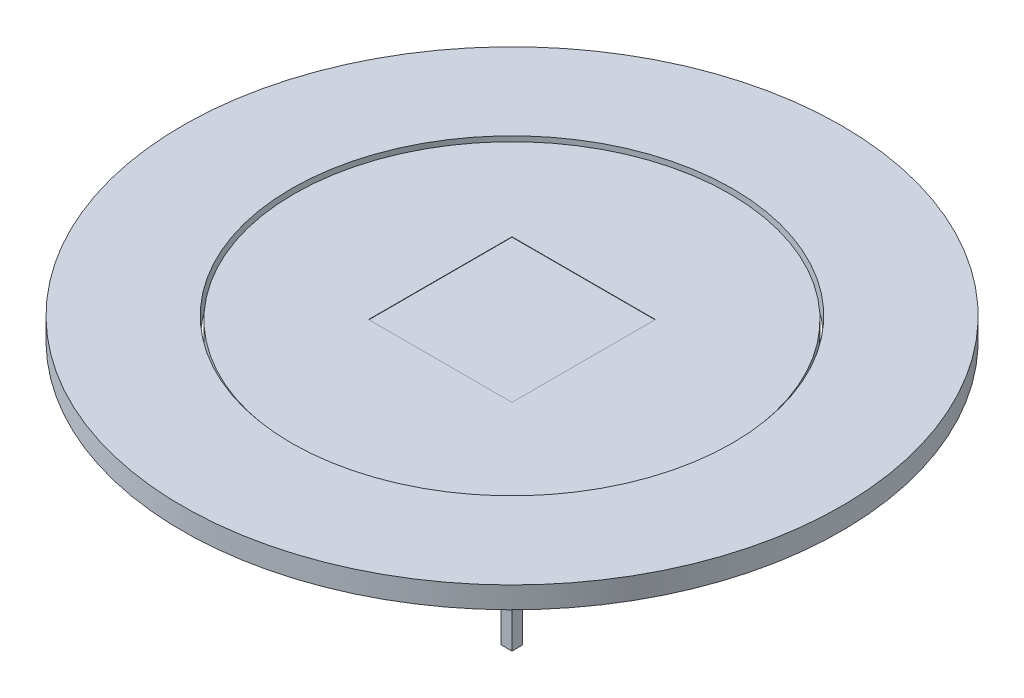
ISO-10303-21;
HEADER;
FILE_DESCRIPTION(('STEP AP214'),'2;1');
FILE_NAME('part.step','',(''),(''),'','','');
FILE_SCHEMA(('AUTOMOTIVE_DESIGN { 1 0 10303 214 1 1 1 1 }'));
ENDSEC;
DATA;
#1=APPLICATION_CONTEXT('core data for automotive mechanical design processes');
#2=APPLICATION_PROTOCOL_DEFINITION('international standard','automotive_design',2000,#1);
#3=PRODUCT_CONTEXT('',#1,'mechanical');
#4=PRODUCT('Part','Part','',(#3));
#5=PRODUCT_RELATED_PRODUCT_CATEGORY('part','',(#4));
#6=PRODUCT_DEFINITION_FORMATION('','',#4);
#7=PRODUCT_DEFINITION_CONTEXT('part definition',#1,'design');
#8=PRODUCT_DEFINITION('design','',#6,#7);
#9=PRODUCT_DEFINITION_SHAPE('','',#8);
#10=(LENGTH_UNIT() NAMED_UNIT(*) SI_UNIT(.MILLI.,.METRE.));
#11=(NAMED_UNIT(*) PLANE_ANGLE_UNIT() SI_UNIT($,.RADIAN.));
#12=(NAMED_UNIT(*) SI_UNIT($,.STERADIAN.) SOLID_ANGLE_UNIT());
#13=UNCERTAINTY_MEASURE_WITH_UNIT(LENGTH_MEASURE(1.E-05),#10,'distance_accuracy_value','');
#14=(GEOMETRIC_REPRESENTATION_CONTEXT(3) GLOBAL_UNCERTAINTY_ASSIGNED_CONTEXT((#13)) GLOBAL_UNIT_ASSIGNED_CONTEXT((#10,
#11,#12)) REPRESENTATION_CONTEXT('',''));
#15=CARTESIAN_POINT('',(0.,0.,0.));
#16=DIRECTION('',(0.,0.,1.));
#17=DIRECTION('',(1.,0.,0.));
#18=AXIS2_PLACEMENT_3D('',#15,#16,#17);
#19=CARTESIAN_POINT('',(20.0000000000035,6.,-19.9999999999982));
#20=DIRECTION('',(0.,-1.,0.));
#21=DIRECTION('',(0.,0.,-1.));
#22=AXIS2_PLACEMENT_3D('',#19,#20,#21);
#23=CYLINDRICAL_SURFACE('',#22,61.4987911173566);
#24=CARTESIAN_POINT('',(20.0000000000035,6.,-19.9999999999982));
#25=DIRECTION('',(0.,-1.,0.));
#26=DIRECTION('',(0.,0.,-1.));
#27=AXIS2_PLACEMENT_3D('',#24,#25,#26);
#28=CIRCLE('',#27,61.4987911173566);
#29=CARTESIAN_POINT('',(20.0000000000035,6.,-81.4987911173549));
#30=VERTEX_POINT('',#29);
#31=EDGE_CURVE('E52',#30,#30,#28,.T.);
#32=ORIENTED_EDGE('',*,*,#31,.F.);
#33=EDGE_LOOP('',(#32));
#34=FACE_BOUND('',#33,.T.);
#35=CARTESIAN_POINT('',(20.0000000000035,0.,-19.9999999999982));
#36=DIRECTION('',(0.,-1.,0.));
#37=DIRECTION('',(0.,0.,-1.));
#38=AXIS2_PLACEMENT_3D('',#35,#36,#37);
#39=CIRCLE('',#38,61.4987911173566);
#40=CARTESIAN_POINT('',(20.0000000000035,0.,-81.4987911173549));
#41=VERTEX_POINT('',#40);
#42=EDGE_CURVE('E58',#41,#41,#39,.T.);
#43=ORIENTED_EDGE('',*,*,#42,.T.);
#44=EDGE_LOOP('',(#43));
#45=FACE_BOUND('',#44,.T.);
#46=ADVANCED_FACE('F45',(#34,#45),#23,.F.);
#47=CARTESIAN_POINT('',(20.0263110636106,6.,-19.9999999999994));
#48=DIRECTION('',(0.,-1.,0.));
#49=DIRECTION('',(0.,0.,-1.));
#50=AXIS2_PLACEMENT_3D('',#47,#48,#49);
#51=CYLINDRICAL_SURFACE('',#50,91.9305322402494);
#52=CARTESIAN_POINT('',(20.0263110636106,6.,-19.9999999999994));
#53=DIRECTION('',(0.,-1.,0.));
#54=DIRECTION('',(0.,0.,-1.));
#55=AXIS2_PLACEMENT_3D('',#52,#53,#54);
#56=CIRCLE('',#55,91.9305322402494);
#57=CARTESIAN_POINT('',(20.0263110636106,6.,-111.930532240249));
#58=VERTEX_POINT('',#57);
#59=EDGE_CURVE('E11',#58,#58,#56,.T.);
#60=ORIENTED_EDGE('',*,*,#59,.T.);
#61=EDGE_LOOP('',(#60));
#62=FACE_BOUND('',#61,.T.);
#63=CARTESIAN_POINT('',(20.0263110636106,0.,-19.9999999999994));
#64=DIRECTION('',(0.,-1.,0.));
#65=DIRECTION('',(0.,0.,-1.));
#66=AXIS2_PLACEMENT_3D('',#63,#64,#65);
#67=CIRCLE('',#66,91.9305322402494);
#68=CARTESIAN_POINT('',(20.0263110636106,0.,-111.930532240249));
#69=VERTEX_POINT('',#68);
#70=EDGE_CURVE('E48',#69,#69,#67,.T.);
#71=ORIENTED_EDGE('',*,*,#70,.F.);
#72=EDGE_LOOP('',(#71));
#73=FACE_BOUND('',#72,.T.);
#74=ADVANCED_FACE('F67',(#62,#73),#51,.T.);
#75=CARTESIAN_POINT('',(0.,6.,0.));
#76=DIRECTION('',(0.,-1.,0.));
#77=DIRECTION('',(0.,0.,-1.));
#78=AXIS2_PLACEMENT_3D('',#75,#76,#77);
#79=PLANE('',#78);
#80=ORIENTED_EDGE('',*,*,#31,.T.);
#81=EDGE_LOOP('',(#80));
#82=FACE_BOUND('',#81,.T.);
#83=ORIENTED_EDGE('',*,*,#59,.F.);
#84=EDGE_LOOP('',(#83));
#85=FACE_BOUND('',#84,.T.);
#86=ADVANCED_FACE('F69',(#82,#85),#79,.F.);
#87=CARTESIAN_POINT('',(0.,0.,0.));
#88=DIRECTION('',(0.,-1.,0.));
#89=DIRECTION('',(0.,0.,-1.));
#90=AXIS2_PLACEMENT_3D('',#87,#88,#89);
#91=PLANE('',#90);
#92=ORIENTED_EDGE('',*,*,#42,.F.);
#93=EDGE_LOOP('',(#92));
#94=FACE_BOUND('',#93,.T.);
#95=ORIENTED_EDGE('',*,*,#70,.T.);
#96=EDGE_LOOP('',(#95));
#97=FACE_BOUND('',#96,.T.);
#98=ADVANCED_FACE('F65',(#94,#97),#91,.T.);
#99=CLOSED_SHELL('',(#46,#74,#86,#98));
#100=MANIFOLD_SOLID_BREP('B2',#99);
#101=CARTESIAN_POINT('',(0.,0.,0.));
#102=DIRECTION('',(0.,-1.,0.));
#103=DIRECTION('',(0.,0.,-1.));
#104=AXIS2_PLACEMENT_3D('',#101,#102,#103);
#105=PLANE('',#104);
#106=DIRECTION('',(0.,0.,-1.));
#107=VECTOR('',#106,1.);
#108=CARTESIAN_POINT('',(37.,0.,0.));
#109=LINE('',#108,#107);
#110=CARTESIAN_POINT('',(37.,0.,5.25486602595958E-12));
#111=VERTEX_POINT('',#110);
#112=CARTESIAN_POINT('',(37.,0.,-3.));
#113=VERTEX_POINT('',#112);
#114=EDGE_CURVE('E952',#111,#113,#109,.T.);
#115=ORIENTED_EDGE('',*,*,#114,.F.);
#116=DIRECTION('',(1.,0.,0.));
#117=VECTOR('',#116,1.);
#118=CARTESIAN_POINT('',(7.66409930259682E-12,0.,5.25486602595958E-12));
#119=LINE('',#118,#117);
#120=CARTESIAN_POINT('',(40.0000000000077,0.,5.25486602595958E-12));
#121=VERTEX_POINT('',#120);
#122=EDGE_CURVE('E714',#111,#121,#119,.T.);
#123=ORIENTED_EDGE('',*,*,#122,.T.);
#124=DIRECTION('',(0.,0.,-1.));
#125=VECTOR('',#124,1.);
#126=CARTESIAN_POINT('',(40.0000000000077,0.,-39.9999999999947));
#127=LINE('',#126,#125);
#128=CARTESIAN_POINT('',(40.0000000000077,0.,-3.));
#129=VERTEX_POINT('',#128);
#130=EDGE_CURVE('E1817',#121,#129,#127,.T.);
#131=ORIENTED_EDGE('',*,*,#130,.T.);
#132=DIRECTION('',(1.,0.,0.));
#133=VECTOR('',#132,1.);
#134=CARTESIAN_POINT('',(40.,0.,-3.));
#135=LINE('',#134,#133);
#136=EDGE_CURVE('E957',#113,#129,#135,.T.);
#137=ORIENTED_EDGE('',*,*,#136,.F.);
#138=EDGE_LOOP('',(#115,#123,#131,#137));
#139=FACE_BOUND('',#138,.T.);
#140=DIRECTION('',(0.,0.,1.));
#141=VECTOR('',#140,1.);
#142=CARTESIAN_POINT('',(7.65920071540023E-12,0.,-39.9999999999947));
#143=LINE('',#142,#141);
#144=CARTESIAN_POINT('',(7.66053886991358E-12,0.,-39.9999999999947));
#145=VERTEX_POINT('',#144);
#146=CARTESIAN_POINT('',(7.65956810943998E-12,0.,-37.));
#147=VERTEX_POINT('',#146);
#148=EDGE_CURVE('E711',#145,#147,#143,.T.);
#149=ORIENTED_EDGE('',*,*,#148,.T.);
#150=DIRECTION('',(-1.,0.,0.));
#151=VECTOR('',#150,1.);
#152=CARTESIAN_POINT('',(0.,0.,-37.));
#153=LINE('',#152,#151);
#154=CARTESIAN_POINT('',(3.,0.,-37.));
#155=VERTEX_POINT('',#154);
#156=EDGE_CURVE('E980',#155,#147,#153,.T.);
#157=ORIENTED_EDGE('',*,*,#156,.F.);
#158=DIRECTION('',(0.,0.,1.));
#159=VECTOR('',#158,1.);
#160=CARTESIAN_POINT('',(3.,0.,-40.));
#161=LINE('',#160,#159);
#162=CARTESIAN_POINT('',(3.,0.,-39.9999999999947));
#163=VERTEX_POINT('',#162);
#164=EDGE_CURVE('E975',#163,#155,#161,.T.);
#165=ORIENTED_EDGE('',*,*,#164,.F.);
#166=DIRECTION('',(-1.,0.,0.));
#167=VECTOR('',#166,1.);
#168=CARTESIAN_POINT('',(7.65920071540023E-12,0.,-39.9999999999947));
#169=LINE('',#168,#167);
#170=EDGE_CURVE('E1148',#163,#145,#169,.T.);
#171=ORIENTED_EDGE('',*,*,#170,.T.);
#172=EDGE_LOOP('',(#149,#157,#165,#171));
#173=FACE_BOUND('',#172,.T.);
#174=DIRECTION('',(-1.,0.,0.));
#175=VECTOR('',#174,1.);
#176=CARTESIAN_POINT('',(40.,0.,-37.));
#177=LINE('',#176,#175);
#178=CARTESIAN_POINT('',(40.0000000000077,0.,-37.));
#179=VERTEX_POINT('',#178);
#180=CARTESIAN_POINT('',(37.,0.,-37.));
#181=VERTEX_POINT('',#180);
#182=EDGE_CURVE('E927',#179,#181,#177,.T.);
#183=ORIENTED_EDGE('',*,*,#182,.F.);
#184=CARTESIAN_POINT('',(40.0000000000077,0.,-39.9999999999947));
#185=VERTEX_POINT('',#184);
#186=EDGE_CURVE('E1821',#179,#185,#127,.T.);
#187=ORIENTED_EDGE('',*,*,#186,.T.);
#188=CARTESIAN_POINT('',(37.,0.,-39.9999999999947));
#189=VERTEX_POINT('',#188);
#190=EDGE_CURVE('E703',#185,#189,#169,.T.);
#191=ORIENTED_EDGE('',*,*,#190,.T.);
#192=DIRECTION('',(0.,0.,-1.));
#193=VECTOR('',#192,1.);
#194=CARTESIAN_POINT('',(37.,0.,-40.));
#195=LINE('',#194,#193);
#196=EDGE_CURVE('E932',#181,#189,#195,.T.);
#197=ORIENTED_EDGE('',*,*,#196,.F.);
#198=EDGE_LOOP('',(#183,#187,#191,#197));
#199=FACE_BOUND('',#198,.T.);
#200=DIRECTION('',(1.,0.,0.));
#201=VECTOR('',#200,1.);
#202=CARTESIAN_POINT('',(24.0870906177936,0.,-18.8831045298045));
#203=LINE('',#202,#201);
#204=CARTESIAN_POINT('',(24.0870906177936,0.,-18.8831045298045));
#205=VERTEX_POINT('',#204);
#206=CARTESIAN_POINT('',(66.1023821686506,0.,-18.8831045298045));
#207=VERTEX_POINT('',#206);
#208=EDGE_CURVE('E684',#205,#207,#203,.T.);
#209=ORIENTED_EDGE('',*,*,#208,.F.);
#210=DIRECTION('',(0.,0.,-1.));
#211=VECTOR('',#210,1.);
#212=CARTESIAN_POINT('',(24.0870906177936,0.,-15.6134320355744));
#213=LINE('',#212,#211);
#214=CARTESIAN_POINT('',(24.0870906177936,0.,-15.6134320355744));
#215=VERTEX_POINT('',#214);
#216=EDGE_CURVE('E670',#215,#205,#213,.T.);
#217=ORIENTED_EDGE('',*,*,#216,.F.);
#218=DIRECTION('',(-1.,0.,0.));
#219=VECTOR('',#218,1.);
#220=CARTESIAN_POINT('',(24.0870906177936,0.,-15.6134320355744));
#221=LINE('',#220,#219);
#222=CARTESIAN_POINT('',(66.1023821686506,0.,-15.6134320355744));
#223=VERTEX_POINT('',#222);
#224=EDGE_CURVE('E675',#223,#215,#221,.T.);
#225=ORIENTED_EDGE('',*,*,#224,.F.);
#226=DIRECTION('',(0.,0.,1.));
#227=VECTOR('',#226,1.);
#228=CARTESIAN_POINT('',(66.1023821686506,0.,-15.6134320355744));
#229=LINE('',#228,#227);
#230=EDGE_CURVE('E686',#207,#223,#229,.T.);
#231=ORIENTED_EDGE('',*,*,#230,.F.);
#232=EDGE_LOOP('',(#209,#217,#225,#231));
#233=FACE_BOUND('',#232,.T.);
#234=DIRECTION('',(0.980428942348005,0.,-0.196873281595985));
#235=VECTOR('',#234,1.);
#236=CARTESIAN_POINT('',(23.2537172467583,0.,-25.9760091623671));
#237=LINE('',#236,#235);
#238=CARTESIAN_POINT('',(23.2537172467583,0.,-25.9760091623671));
#239=VERTEX_POINT('',#238);
#240=CARTESIAN_POINT('',(63.9611397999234,0.,-34.1501903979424));
#241=VERTEX_POINT('',#240);
#242=EDGE_CURVE('E655',#239,#241,#237,.T.);
#243=ORIENTED_EDGE('',*,*,#242,.F.);
#244=DIRECTION('',(-0.196873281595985,0.,-0.980428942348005));
#245=VECTOR('',#244,1.);
#246=CARTESIAN_POINT('',(24.0870906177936,0.,-21.8258097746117));
#247=LINE('',#246,#245);
#248=CARTESIAN_POINT('',(24.0870906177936,0.,-21.8258097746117));
#249=VERTEX_POINT('',#248);
#250=EDGE_CURVE('E641',#249,#239,#247,.T.);
#251=ORIENTED_EDGE('',*,*,#250,.F.);
#252=DIRECTION('',(-0.980428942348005,0.,0.196873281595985));
#253=VECTOR('',#252,1.);
#254=CARTESIAN_POINT('',(24.0870906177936,0.,-21.8258097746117));
#255=LINE('',#254,#253);
#256=CARTESIAN_POINT('',(64.7945131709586,0.,-29.999991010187));
#257=VERTEX_POINT('',#256);
#258=EDGE_CURVE('E646',#257,#249,#255,.T.);
#259=ORIENTED_EDGE('',*,*,#258,.F.);
#260=DIRECTION('',(0.196873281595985,0.,0.980428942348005));
#261=VECTOR('',#260,1.);
#262=CARTESIAN_POINT('',(64.7945131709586,0.,-29.999991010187));
#263=LINE('',#262,#261);
#264=EDGE_CURVE('E657',#241,#257,#263,.T.);
#265=ORIENTED_EDGE('',*,*,#264,.F.);
#266=EDGE_LOOP('',(#243,#251,#259,#265));
#267=FACE_BOUND('',#266,.T.);
#268=DIRECTION('',(0.960501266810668,0.,0.278275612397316));
#269=VECTOR('',#268,1.);
#270=CARTESIAN_POINT('',(25.2084948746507,0.,-14.9065502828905));
#271=LINE('',#270,#269);
#272=CARTESIAN_POINT('',(25.2084948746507,0.,-14.9065502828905));
#273=VERTEX_POINT('',#272);
#274=CARTESIAN_POINT('',(63.3001794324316,0.,-3.87065973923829));
#275=VERTEX_POINT('',#274);
#276=EDGE_CURVE('E626',#273,#275,#271,.T.);
#277=ORIENTED_EDGE('',*,*,#276,.F.);
#278=DIRECTION('',(0.278275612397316,0.,-0.960501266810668));
#279=VECTOR('',#278,1.);
#280=CARTESIAN_POINT('',(24.0870906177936,0.,-11.0358905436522));
#281=LINE('',#280,#279);
#282=CARTESIAN_POINT('',(24.0870906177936,0.,-11.0358905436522));
#283=VERTEX_POINT('',#282);
#284=EDGE_CURVE('E612',#283,#273,#281,.T.);
#285=ORIENTED_EDGE('',*,*,#284,.F.);
#286=DIRECTION('',(-0.960501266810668,0.,-0.278275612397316));
#287=VECTOR('',#286,1.);
#288=CARTESIAN_POINT('',(24.0870906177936,0.,-11.0358905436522));
#289=LINE('',#288,#287);
#290=CARTESIAN_POINT('',(62.1787751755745,0.,0.));
#291=VERTEX_POINT('',#290);
#292=EDGE_CURVE('E617',#291,#283,#289,.T.);
#293=ORIENTED_EDGE('',*,*,#292,.F.);
#294=DIRECTION('',(-0.278275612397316,0.,0.960501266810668));
#295=VECTOR('',#294,1.);
#296=CARTESIAN_POINT('',(62.1787751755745,0.,0.));
#297=LINE('',#296,#295);
#298=EDGE_CURVE('E628',#275,#291,#297,.T.);
#299=ORIENTED_EDGE('',*,*,#298,.F.);
#300=EDGE_LOOP('',(#277,#285,#293,#299));
#301=FACE_BOUND('',#300,.T.);
#302=CARTESIAN_POINT('',(20.0000000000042,0.,-19.9999999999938));
#303=DIRECTION('',(0.,1.,0.));
#304=DIRECTION('',(0.,0.,-1.));
#305=AXIS2_PLACEMENT_3D('',#302,#303,#304);
#306=CIRCLE('',#305,60.7624523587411);
#307=CARTESIAN_POINT('',(79.0383708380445,0.,-34.371721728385));
#308=VERTEX_POINT('',#307);
#309=CARTESIAN_POINT('',(-7.54855733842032,0.,34.1585875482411));
#310=VERTEX_POINT('',#309);
#311=EDGE_CURVE('E1834',#308,#310,#306,.T.);
#312=ORIENTED_EDGE('',*,*,#311,.F.);
#313=DIRECTION('',(0.930913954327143,0.,-0.365238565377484));
#314=VECTOR('',#313,1.);
#315=CARTESIAN_POINT('',(70.1640555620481,0.,-30.8899367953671));
#316=LINE('',#315,#314);
#317=CARTESIAN_POINT('',(70.1640555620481,0.,-30.8899367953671));
#318=VERTEX_POINT('',#317);
#319=EDGE_CURVE('E125',#318,#308,#316,.T.);
#320=ORIENTED_EDGE('',*,*,#319,.F.);
#321=DIRECTION('',(-0.365238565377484,0.,-0.930913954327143));
#322=VECTOR('',#321,1.);
#323=CARTESIAN_POINT('',(71.7334318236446,0.,-26.8899367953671));
#324=LINE('',#323,#322);
#325=CARTESIAN_POINT('',(71.7334318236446,0.,-26.8899367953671));
#326=VERTEX_POINT('',#325);
#327=EDGE_CURVE('E575',#326,#318,#324,.T.);
#328=ORIENTED_EDGE('',*,*,#327,.F.);
#329=DIRECTION('',(-0.930913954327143,0.,0.365238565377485));
#330=VECTOR('',#329,1.);
#331=CARTESIAN_POINT('',(71.7334318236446,0.,-26.8899367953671));
#332=LINE('',#331,#330);
#333=CARTESIAN_POINT('',(79.91703413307,0.,-30.1007245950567));
#334=VERTEX_POINT('',#333);
#335=EDGE_CURVE('E1916',#334,#326,#332,.T.);
#336=ORIENTED_EDGE('',*,*,#335,.F.);
#337=CARTESIAN_POINT('',(80.7441520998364,0.,-18.5088251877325));
#338=VERTEX_POINT('',#337);
#339=EDGE_CURVE('E1845',#338,#334,#306,.T.);
#340=ORIENTED_EDGE('',*,*,#339,.F.);
#341=DIRECTION('',(1.,0.,0.));
#342=VECTOR('',#341,1.);
#343=CARTESIAN_POINT('',(70.4403389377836,0.,-18.5088251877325));
#344=LINE('',#343,#342);
#345=CARTESIAN_POINT('',(70.4403389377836,0.,-18.5088251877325));
#346=VERTEX_POINT('',#345);
#347=EDGE_CURVE('E133',#346,#338,#344,.T.);
#348=ORIENTED_EDGE('',*,*,#347,.F.);
#349=DIRECTION('',(0.,0.,-1.));
#350=VECTOR('',#349,1.);
#351=CARTESIAN_POINT('',(70.4403389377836,0.,-14.5088251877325));
#352=LINE('',#351,#350);
#353=CARTESIAN_POINT('',(70.4403389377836,0.,-14.5088251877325));
#354=VERTEX_POINT('',#353);
#355=EDGE_CURVE('E576',#354,#346,#352,.T.);
#356=ORIENTED_EDGE('',*,*,#355,.F.);
#357=DIRECTION('',(-1.,0.,0.));
#358=VECTOR('',#357,1.);
#359=CARTESIAN_POINT('',(70.4403389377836,0.,-14.5088251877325));
#360=LINE('',#359,#358);
#361=CARTESIAN_POINT('',(80.5138216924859,0.,-14.5088251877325));
#362=VERTEX_POINT('',#361);
#363=EDGE_CURVE('E599',#362,#354,#360,.T.);
#364=ORIENTED_EDGE('',*,*,#363,.F.);
#365=CARTESIAN_POINT('',(49.2884358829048,0.,33.2377980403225));
#366=VERTEX_POINT('',#365);
#367=EDGE_CURVE('E1850',#366,#362,#306,.T.);
#368=ORIENTED_EDGE('',*,*,#367,.F.);
#369=DIRECTION('',(0.401550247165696,0.,0.915836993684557));
#370=VECTOR('',#369,1.);
#371=CARTESIAN_POINT('',(45.0350482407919,0.,23.5368707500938));
#372=LINE('',#371,#370);
#373=CARTESIAN_POINT('',(45.0350482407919,0.,23.5368707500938));
#374=VERTEX_POINT('',#373);
#375=EDGE_CURVE('E758',#374,#366,#372,.T.);
#376=ORIENTED_EDGE('',*,*,#375,.F.);
#377=DIRECTION('',(-0.915836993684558,0.,0.401550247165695));
#378=VECTOR('',#377,1.);
#379=CARTESIAN_POINT('',(45.0350482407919,0.,23.5368707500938));
#380=LINE('',#379,#378);
#381=CARTESIAN_POINT('',(46.4514251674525,0.,22.9158579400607));
#382=VERTEX_POINT('',#381);
#383=EDGE_CURVE('E754',#382,#374,#380,.T.);
#384=ORIENTED_EDGE('',*,*,#383,.F.);
#385=DIRECTION('',(0.401550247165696,0.,0.915836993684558));
#386=VECTOR('',#385,1.);
#387=CARTESIAN_POINT('',(34.1185430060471,0.,-5.21240197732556));
#388=LINE('',#387,#386);
#389=CARTESIAN_POINT('',(34.1185430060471,0.,-5.21240197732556));
#390=VERTEX_POINT('',#389);
#391=EDGE_CURVE('E752',#390,#382,#388,.T.);
#392=ORIENTED_EDGE('',*,*,#391,.F.);
#393=DIRECTION('',(0.915836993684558,0.,-0.401550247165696));
#394=VECTOR('',#393,1.);
#395=CARTESIAN_POINT('',(26.7918470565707,0.,-2.));
#396=LINE('',#395,#394);
#397=CARTESIAN_POINT('',(26.7918470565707,0.,-2.));
#398=VERTEX_POINT('',#397);
#399=EDGE_CURVE('E730',#398,#390,#396,.T.);
#400=ORIENTED_EDGE('',*,*,#399,.F.);
#401=DIRECTION('',(-0.401550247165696,0.,-0.915836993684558));
#402=VECTOR('',#401,1.);
#403=CARTESIAN_POINT('',(26.7918470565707,0.,-2.));
#404=LINE('',#403,#402);
#405=CARTESIAN_POINT('',(39.124729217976,0.,26.1282599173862));
#406=VERTEX_POINT('',#405);
#407=EDGE_CURVE('E735',#406,#398,#404,.T.);
#408=ORIENTED_EDGE('',*,*,#407,.F.);
#409=DIRECTION('',(-0.915836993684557,0.,0.401550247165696));
#410=VECTOR('',#409,1.);
#411=CARTESIAN_POINT('',(39.124729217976,0.,26.1282599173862));
#412=LINE('',#411,#410);
#413=CARTESIAN_POINT('',(40.8019609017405,0.,25.3928749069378));
#414=VERTEX_POINT('',#413);
#415=EDGE_CURVE('E766',#414,#406,#412,.T.);
#416=ORIENTED_EDGE('',*,*,#415,.F.);
#417=DIRECTION('',(0.401550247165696,0.,0.915836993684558));
#418=VECTOR('',#417,1.);
#419=CARTESIAN_POINT('',(40.8019609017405,0.,25.3928749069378));
#420=LINE('',#419,#418);
#421=CARTESIAN_POINT('',(45.1512972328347,0.,35.3126374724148));
#422=VERTEX_POINT('',#421);
#423=EDGE_CURVE('E722',#414,#422,#420,.T.);
#424=ORIENTED_EDGE('',*,*,#423,.T.);
#425=CARTESIAN_POINT('',(21.7426417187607,0.,40.7374581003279));
#426=VERTEX_POINT('',#425);
#427=EDGE_CURVE('E1854',#426,#422,#306,.T.);
#428=ORIENTED_EDGE('',*,*,#427,.F.);
#429=DIRECTION('',(0.,0.,1.));
#430=VECTOR('',#429,1.);
#431=CARTESIAN_POINT('',(21.7426417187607,0.,28.));
#432=LINE('',#431,#430);
#433=CARTESIAN_POINT('',(21.7426417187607,0.,28.));
#434=VERTEX_POINT('',#433);
#435=EDGE_CURVE('E894',#434,#426,#432,.T.);
#436=ORIENTED_EDGE('',*,*,#435,.F.);
#437=DIRECTION('',(-1.,0.,0.));
#438=VECTOR('',#437,1.);
#439=CARTESIAN_POINT('',(21.7426417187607,0.,28.));
#440=LINE('',#439,#438);
#441=CARTESIAN_POINT('',(23.7918470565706,0.,28.));
#442=VERTEX_POINT('',#441);
#443=EDGE_CURVE('E890',#442,#434,#440,.T.);
#444=ORIENTED_EDGE('',*,*,#443,.F.);
#445=DIRECTION('',(0.,0.,1.));
#446=VECTOR('',#445,1.);
#447=CARTESIAN_POINT('',(23.7918470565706,0.,-2.));
#448=LINE('',#447,#446);
#449=CARTESIAN_POINT('',(23.7918470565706,0.,-2.));
#450=VERTEX_POINT('',#449);
#451=EDGE_CURVE('E888',#450,#442,#448,.T.);
#452=ORIENTED_EDGE('',*,*,#451,.F.);
#453=DIRECTION('',(1.,0.,0.));
#454=VECTOR('',#453,1.);
#455=CARTESIAN_POINT('',(15.7918470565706,0.,-2.));
#456=LINE('',#455,#454);
#457=CARTESIAN_POINT('',(15.7918470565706,0.,-2.));
#458=VERTEX_POINT('',#457);
#459=EDGE_CURVE('E886',#458,#450,#456,.T.);
#460=ORIENTED_EDGE('',*,*,#459,.F.);
#461=DIRECTION('',(0.,0.,-1.));
#462=VECTOR('',#461,1.);
#463=CARTESIAN_POINT('',(15.7918470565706,0.,-2.));
#464=LINE('',#463,#462);
#465=CARTESIAN_POINT('',(15.7918470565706,0.,28.));
#466=VERTEX_POINT('',#465);
#467=EDGE_CURVE('E865',#466,#458,#464,.T.);
#468=ORIENTED_EDGE('',*,*,#467,.F.);
#469=DIRECTION('',(-1.,0.,0.));
#470=VECTOR('',#469,1.);
#471=CARTESIAN_POINT('',(15.7918470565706,0.,28.));
#472=LINE('',#471,#470);
#473=CARTESIAN_POINT('',(17.7544819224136,0.,28.));
#474=VERTEX_POINT('',#473);
#475=EDGE_CURVE('E870',#474,#466,#472,.T.);
#476=ORIENTED_EDGE('',*,*,#475,.F.);
#477=DIRECTION('',(0.,0.,1.));
#478=VECTOR('',#477,1.);
#479=CARTESIAN_POINT('',(17.7544819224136,0.,28.));
#480=LINE('',#479,#478);
#481=CARTESIAN_POINT('',(17.7544819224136,0.,40.7209458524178));
#482=VERTEX_POINT('',#481);
#483=EDGE_CURVE('E728',#474,#482,#480,.T.);
#484=ORIENTED_EDGE('',*,*,#483,.T.);
#485=CARTESIAN_POINT('',(-3.91300076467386,0.,35.8591443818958));
#486=VERTEX_POINT('',#485);
#487=EDGE_CURVE('E1838',#486,#482,#306,.T.);
#488=ORIENTED_EDGE('',*,*,#487,.F.);
#489=DIRECTION('',(-0.347692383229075,0.,0.937608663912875));
#490=VECTOR('',#489,1.);
#491=CARTESIAN_POINT('',(-0.0833906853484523,0.,25.5319823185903));
#492=LINE('',#491,#490);
#493=CARTESIAN_POINT('',(-0.0833906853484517,0.,25.5319823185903));
#494=VERTEX_POINT('',#493);
#495=EDGE_CURVE('E822',#494,#486,#492,.T.);
#496=ORIENTED_EDGE('',*,*,#495,.F.);
#497=DIRECTION('',(-0.937608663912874,0.,-0.347692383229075));
#498=VECTOR('',#497,1.);
#499=CARTESIAN_POINT('',(1.52456815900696,0.,26.1282599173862));
#500=LINE('',#499,#498);
#501=CARTESIAN_POINT('',(1.52456815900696,0.,26.1282599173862));
#502=VERTEX_POINT('',#501);
#503=EDGE_CURVE('E818',#502,#494,#500,.T.);
#504=ORIENTED_EDGE('',*,*,#503,.F.);
#505=DIRECTION('',(-0.347692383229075,0.,0.937608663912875));
#506=VECTOR('',#505,1.);
#507=CARTESIAN_POINT('',(11.9553396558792,0.,-2.));
#508=LINE('',#507,#506);
#509=CARTESIAN_POINT('',(11.9553396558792,0.,-2.));
#510=VERTEX_POINT('',#509);
#511=EDGE_CURVE('E816',#510,#502,#508,.T.);
#512=ORIENTED_EDGE('',*,*,#511,.F.);
#513=DIRECTION('',(0.937608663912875,0.,0.347692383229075));
#514=VECTOR('',#513,1.);
#515=CARTESIAN_POINT('',(11.9553396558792,0.,-2.));
#516=LINE('',#515,#514);
#517=CARTESIAN_POINT('',(4.45447034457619,0.,-4.7815390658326));
#518=VERTEX_POINT('',#517);
#519=EDGE_CURVE('E792',#518,#510,#516,.T.);
#520=ORIENTED_EDGE('',*,*,#519,.F.);
#521=DIRECTION('',(0.347692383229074,0.,-0.937608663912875));
#522=VECTOR('',#521,1.);
#523=CARTESIAN_POINT('',(4.45447034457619,0.,-4.7815390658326));
#524=LINE('',#523,#522);
#525=CARTESIAN_POINT('',(3.,0.,-0.859324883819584));
#526=VERTEX_POINT('',#525);
#527=EDGE_CURVE('E833',#526,#518,#524,.T.);
#528=ORIENTED_EDGE('',*,*,#527,.F.);
#529=DIRECTION('',(0.,0.,1.));
#530=VECTOR('',#529,1.);
#531=CARTESIAN_POINT('',(3.,0.,0.));
#532=LINE('',#531,#530);
#533=CARTESIAN_POINT('',(3.,0.,-3.));
#534=VERTEX_POINT('',#533);
#535=EDGE_CURVE('E1003',#534,#526,#532,.T.);
#536=ORIENTED_EDGE('',*,*,#535,.F.);
#537=DIRECTION('',(1.,0.,0.));
#538=VECTOR('',#537,1.);
#539=CARTESIAN_POINT('',(0.,0.,-3.));
#540=LINE('',#539,#538);
#541=CARTESIAN_POINT('',(7.66373190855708E-12,0.,-3.));
#542=VERTEX_POINT('',#541);
#543=EDGE_CURVE('E998',#542,#534,#540,.T.);
#544=ORIENTED_EDGE('',*,*,#543,.F.);
#545=CARTESIAN_POINT('',(7.66409930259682E-12,0.,5.25486602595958E-12));
#546=VERTEX_POINT('',#545);
#547=EDGE_CURVE('E699',#542,#546,#143,.T.);
#548=ORIENTED_EDGE('',*,*,#547,.T.);
#549=CARTESIAN_POINT('',(2.68133750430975,0.,5.25486602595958E-12));
#550=VERTEX_POINT('',#549);
#551=EDGE_CURVE('E715',#546,#550,#119,.T.);
#552=ORIENTED_EDGE('',*,*,#551,.T.);
#553=CARTESIAN_POINT('',(-5.97630115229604,0.,23.3467208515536));
#554=VERTEX_POINT('',#553);
#555=EDGE_CURVE('E797',#554,#550,#524,.T.);
#556=ORIENTED_EDGE('',*,*,#555,.F.);
#557=DIRECTION('',(-0.937608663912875,0.,-0.347692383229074));
#558=VECTOR('',#557,1.);
#559=CARTESIAN_POINT('',(-3.83382534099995,0.,24.141212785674));
#560=LINE('',#559,#558);
#561=CARTESIAN_POINT('',(-3.83382534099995,0.,24.141212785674));
#562=VERTEX_POINT('',#561);
#563=EDGE_CURVE('E830',#562,#554,#560,.T.);
#564=ORIENTED_EDGE('',*,*,#563,.F.);
#565=DIRECTION('',(-0.347692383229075,0.,0.937608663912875));
#566=VECTOR('',#565,1.);
#567=CARTESIAN_POINT('',(-3.83382534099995,0.,24.141212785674));
#568=LINE('',#567,#566);
#569=EDGE_CURVE('E724',#562,#310,#568,.T.);
#570=ORIENTED_EDGE('',*,*,#569,.T.);
#571=EDGE_LOOP('',(#312,#320,#328,#336,#340,#348,#356,#364,#368,#376,#384,#392,#400,#408,#416,
#424,#428,#436,#444,#452,#460,#468,#476,#484,#488,#496,#504,#512,#520,#528,#536,#544,#548,#552,
#556,#564,#570));
#572=FACE_BOUND('',#571,.T.);
#573=ADVANCED_FACE('F110',(#139,#173,#199,#233,#267,#301,#572),#105,.T.);
#574=CARTESIAN_POINT('',(0.,5.,0.));
#575=DIRECTION('',(0.,0.,-1.));
#576=DIRECTION('',(-1.,0.,0.));
#577=AXIS2_PLACEMENT_3D('',#574,#575,#576);
#578=PLANE('',#577);
#579=ORIENTED_EDGE('',*,*,#551,.F.);
#580=DIRECTION('',(0.,-1.,0.));
#581=VECTOR('',#580,1.);
#582=CARTESIAN_POINT('',(0.,5.,0.));
#583=LINE('',#582,#581);
#584=CARTESIAN_POINT('',(0.,-55.,0.));
#585=VERTEX_POINT('',#584);
#586=EDGE_CURVE('E1025',#546,#585,#583,.T.);
#587=ORIENTED_EDGE('',*,*,#586,.T.);
#588=DIRECTION('',(-1.,0.,0.));
#589=VECTOR('',#588,1.);
#590=CARTESIAN_POINT('',(0.,-55.,0.));
#591=LINE('',#590,#589);
#592=CARTESIAN_POINT('',(3.,-55.,0.));
#593=VERTEX_POINT('',#592);
#594=EDGE_CURVE('E1007',#593,#585,#591,.T.);
#595=ORIENTED_EDGE('',*,*,#594,.F.);
#596=DIRECTION('',(0.,1.,0.));
#597=VECTOR('',#596,1.);
#598=CARTESIAN_POINT('',(3.,-55.,0.));
#599=LINE('',#598,#597);
#600=CARTESIAN_POINT('',(3.,-2.,0.));
#601=VERTEX_POINT('',#600);
#602=EDGE_CURVE('E1010',#593,#601,#599,.T.);
#603=ORIENTED_EDGE('',*,*,#602,.T.);
#604=DIRECTION('',(1.,0.,0.));
#605=VECTOR('',#604,1.);
#606=CARTESIAN_POINT('',(0.,-2.,0.));
#607=LINE('',#606,#605);
#608=CARTESIAN_POINT('',(2.68133750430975,-2.,0.));
#609=VERTEX_POINT('',#608);
#610=EDGE_CURVE('E859',#609,#601,#607,.T.);
#611=ORIENTED_EDGE('',*,*,#610,.F.);
#612=DIRECTION('',(0.,-1.,0.));
#613=VECTOR('',#612,1.);
#614=CARTESIAN_POINT('',(2.68133750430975,5.,0.));
#615=LINE('',#614,#613);
#616=EDGE_CURVE('E862',#550,#609,#615,.T.);
#617=ORIENTED_EDGE('',*,*,#616,.F.);
#618=EDGE_LOOP('',(#579,#587,#595,#603,#611,#617));
#619=FACE_BOUND('',#618,.T.);
#620=ADVANCED_FACE('F1103',(#619),#578,.F.);
#621=ORIENTED_EDGE('',*,*,#122,.F.);
#622=DIRECTION('',(0.,1.,0.));
#623=VECTOR('',#622,1.);
#624=CARTESIAN_POINT('',(37.,-55.,0.));
#625=LINE('',#624,#623);
#626=CARTESIAN_POINT('',(37.,-55.,0.));
#627=VERTEX_POINT('',#626);
#628=EDGE_CURVE('E972',#627,#111,#625,.T.);
#629=ORIENTED_EDGE('',*,*,#628,.F.);
#630=DIRECTION('',(-1.,0.,0.));
#631=VECTOR('',#630,1.);
#632=CARTESIAN_POINT('',(40.,-55.,0.));
#633=LINE('',#632,#631);
#634=CARTESIAN_POINT('',(40.,-55.,0.));
#635=VERTEX_POINT('',#634);
#636=EDGE_CURVE('E956',#635,#627,#633,.T.);
#637=ORIENTED_EDGE('',*,*,#636,.F.);
#638=DIRECTION('',(0.,-1.,0.));
#639=VECTOR('',#638,1.);
#640=CARTESIAN_POINT('',(40.,5.,0.));
#641=LINE('',#640,#639);
#642=EDGE_CURVE('E1028',#121,#635,#641,.T.);
#643=ORIENTED_EDGE('',*,*,#642,.F.);
#644=EDGE_LOOP('',(#621,#629,#637,#643));
#645=FACE_BOUND('',#644,.T.);
#646=ADVANCED_FACE('F1110',(#645),#578,.F.);
#647=CARTESIAN_POINT('',(0.,5.,0.));
#648=DIRECTION('',(-1.,0.,0.));
#649=DIRECTION('',(0.,0.,1.));
#650=AXIS2_PLACEMENT_3D('',#647,#648,#649);
#651=PLANE('',#650);
#652=ORIENTED_EDGE('',*,*,#586,.F.);
#653=ORIENTED_EDGE('',*,*,#547,.F.);
#654=DIRECTION('',(0.,1.,0.));
#655=VECTOR('',#654,1.);
#656=CARTESIAN_POINT('',(0.,-55.,-3.));
#657=LINE('',#656,#655);
#658=CARTESIAN_POINT('',(0.,-55.,-3.));
#659=VERTEX_POINT('',#658);
#660=EDGE_CURVE('E1046',#659,#542,#657,.T.);
#661=ORIENTED_EDGE('',*,*,#660,.F.);
#662=DIRECTION('',(0.,0.,-1.));
#663=VECTOR('',#662,1.);
#664=CARTESIAN_POINT('',(0.,-55.,0.));
#665=LINE('',#664,#663);
#666=EDGE_CURVE('E999',#585,#659,#665,.T.);
#667=ORIENTED_EDGE('',*,*,#666,.F.);
#668=EDGE_LOOP('',(#652,#653,#661,#667));
#669=FACE_BOUND('',#668,.T.);
#670=ADVANCED_FACE('F112',(#669),#651,.T.);
#671=DIRECTION('',(0.,1.,0.));
#672=VECTOR('',#671,1.);
#673=CARTESIAN_POINT('',(0.,-55.,-37.));
#674=LINE('',#673,#672);
#675=CARTESIAN_POINT('',(0.,-55.,-37.));
#676=VERTEX_POINT('',#675);
#677=EDGE_CURVE('E986',#676,#147,#674,.T.);
#678=ORIENTED_EDGE('',*,*,#677,.T.);
#679=ORIENTED_EDGE('',*,*,#148,.F.);
#680=DIRECTION('',(0.,-1.,0.));
#681=VECTOR('',#680,1.);
#682=CARTESIAN_POINT('',(0.,5.,-40.));
#683=LINE('',#682,#681);
#684=CARTESIAN_POINT('',(0.,-55.,-40.));
#685=VERTEX_POINT('',#684);
#686=EDGE_CURVE('E1041',#145,#685,#683,.T.);
#687=ORIENTED_EDGE('',*,*,#686,.T.);
#688=DIRECTION('',(0.,0.,-1.));
#689=VECTOR('',#688,1.);
#690=CARTESIAN_POINT('',(0.,-55.,-40.));
#691=LINE('',#690,#689);
#692=EDGE_CURVE('E976',#676,#685,#691,.T.);
#693=ORIENTED_EDGE('',*,*,#692,.F.);
#694=EDGE_LOOP('',(#678,#679,#687,#693));
#695=FACE_BOUND('',#694,.T.);
#696=ADVANCED_FACE('F1109',(#695),#651,.T.);
#697=CARTESIAN_POINT('',(40.,5.,0.));
#698=DIRECTION('',(-1.,0.,0.));
#699=DIRECTION('',(0.,0.,1.));
#700=AXIS2_PLACEMENT_3D('',#697,#698,#699);
#701=PLANE('',#700);
#702=ORIENTED_EDGE('',*,*,#130,.F.);
#703=ORIENTED_EDGE('',*,*,#642,.T.);
#704=DIRECTION('',(0.,0.,1.));
#705=VECTOR('',#704,1.);
#706=CARTESIAN_POINT('',(40.,-55.,0.));
#707=LINE('',#706,#705);
#708=CARTESIAN_POINT('',(40.,-55.,-3.));
#709=VERTEX_POINT('',#708);
#710=EDGE_CURVE('E953',#709,#635,#707,.T.);
#711=ORIENTED_EDGE('',*,*,#710,.F.);
#712=DIRECTION('',(0.,1.,0.));
#713=VECTOR('',#712,1.);
#714=CARTESIAN_POINT('',(40.,-55.,-3.));
#715=LINE('',#714,#713);
#716=EDGE_CURVE('E963',#709,#129,#715,.T.);
#717=ORIENTED_EDGE('',*,*,#716,.T.);
#718=EDGE_LOOP('',(#702,#703,#711,#717));
#719=FACE_BOUND('',#718,.T.);
#720=ADVANCED_FACE('F1115',(#719),#701,.F.);
#721=ORIENTED_EDGE('',*,*,#186,.F.);
#722=DIRECTION('',(0.,1.,0.));
#723=VECTOR('',#722,1.);
#724=CARTESIAN_POINT('',(40.,-55.,-37.));
#725=LINE('',#724,#723);
#726=CARTESIAN_POINT('',(40.,-55.,-37.));
#727=VERTEX_POINT('',#726);
#728=EDGE_CURVE('E949',#727,#179,#725,.T.);
#729=ORIENTED_EDGE('',*,*,#728,.F.);
#730=DIRECTION('',(0.,0.,1.));
#731=VECTOR('',#730,1.);
#732=CARTESIAN_POINT('',(40.,-55.,-40.));
#733=LINE('',#732,#731);
#734=CARTESIAN_POINT('',(40.,-55.,-40.));
#735=VERTEX_POINT('',#734);
#736=EDGE_CURVE('E928',#735,#727,#733,.T.);
#737=ORIENTED_EDGE('',*,*,#736,.F.);
#738=DIRECTION('',(0.,-1.,0.));
#739=VECTOR('',#738,1.);
#740=CARTESIAN_POINT('',(40.,5.,-40.));
#741=LINE('',#740,#739);
#742=EDGE_CURVE('E1034',#185,#735,#741,.T.);
#743=ORIENTED_EDGE('',*,*,#742,.F.);
#744=EDGE_LOOP('',(#721,#729,#737,#743));
#745=FACE_BOUND('',#744,.T.);
#746=ADVANCED_FACE('F1132',(#745),#701,.F.);
#747=CARTESIAN_POINT('',(0.,5.,-40.));
#748=DIRECTION('',(0.,0.,-1.));
#749=DIRECTION('',(-1.,0.,0.));
#750=AXIS2_PLACEMENT_3D('',#747,#748,#749);
#751=PLANE('',#750);
#752=ORIENTED_EDGE('',*,*,#686,.F.);
#753=ORIENTED_EDGE('',*,*,#170,.F.);
#754=DIRECTION('',(0.,1.,0.));
#755=VECTOR('',#754,1.);
#756=CARTESIAN_POINT('',(3.,-55.,-40.));
#757=LINE('',#756,#755);
#758=CARTESIAN_POINT('',(3.,-55.,-40.));
#759=VERTEX_POINT('',#758);
#760=EDGE_CURVE('E995',#759,#163,#757,.T.);
#761=ORIENTED_EDGE('',*,*,#760,.F.);
#762=DIRECTION('',(1.,0.,0.));
#763=VECTOR('',#762,1.);
#764=CARTESIAN_POINT('',(0.,-55.,-40.));
#765=LINE('',#764,#763);
#766=EDGE_CURVE('E979',#685,#759,#765,.T.);
#767=ORIENTED_EDGE('',*,*,#766,.F.);
#768=EDGE_LOOP('',(#752,#753,#761,#767));
#769=FACE_BOUND('',#768,.T.);
#770=ADVANCED_FACE('F1134',(#769),#751,.T.);
#771=DIRECTION('',(0.,1.,0.));
#772=VECTOR('',#771,1.);
#773=CARTESIAN_POINT('',(37.,-55.,-40.));
#774=LINE('',#773,#772);
#775=CARTESIAN_POINT('',(37.,-55.,-40.));
#776=VERTEX_POINT('',#775);
#777=EDGE_CURVE('E939',#776,#189,#774,.T.);
#778=ORIENTED_EDGE('',*,*,#777,.T.);
#779=ORIENTED_EDGE('',*,*,#190,.F.);
#780=ORIENTED_EDGE('',*,*,#742,.T.);
#781=DIRECTION('',(1.,0.,0.));
#782=VECTOR('',#781,1.);
#783=CARTESIAN_POINT('',(40.,-55.,-40.));
#784=LINE('',#783,#782);
#785=EDGE_CURVE('E936',#776,#735,#784,.T.);
#786=ORIENTED_EDGE('',*,*,#785,.F.);
#787=EDGE_LOOP('',(#778,#779,#780,#786));
#788=FACE_BOUND('',#787,.T.);
#789=ADVANCED_FACE('F1136',(#788),#751,.T.);
#790=CARTESIAN_POINT('',(0.,0.,0.));
#791=DIRECTION('',(0.,1.,0.));
#792=DIRECTION('',(0.,0.,1.));
#793=AXIS2_PLACEMENT_3D('',#790,#791,#792);
#794=PLANE('',#793);
#795=CARTESIAN_POINT('',(21.7426417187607,0.,58.));
#796=VERTEX_POINT('',#795);
#797=EDGE_CURVE('E893',#426,#796,#432,.T.);
#798=ORIENTED_EDGE('',*,*,#797,.F.);
#799=EDGE_CURVE('E1842',#482,#426,#306,.T.);
#800=ORIENTED_EDGE('',*,*,#799,.F.);
#801=DIRECTION('',(0.,0.,-1.));
#802=VECTOR('',#801,1.);
#803=CARTESIAN_POINT('',(17.7544819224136,0.,28.));
#804=LINE('',#803,#802);
#805=CARTESIAN_POINT('',(17.7544819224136,0.,58.));
#806=VERTEX_POINT('',#805);
#807=EDGE_CURVE('E899',#806,#482,#804,.T.);
#808=ORIENTED_EDGE('',*,*,#807,.F.);
#809=DIRECTION('',(-1.,0.,0.));
#810=VECTOR('',#809,1.);
#811=CARTESIAN_POINT('',(17.7544819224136,0.,58.));
#812=LINE('',#811,#810);
#813=EDGE_CURVE('E897',#796,#806,#812,.T.);
#814=ORIENTED_EDGE('',*,*,#813,.F.);
#815=EDGE_LOOP('',(#798,#800,#808,#814));
#816=FACE_BOUND('',#815,.T.);
#817=ADVANCED_FACE('F1142',(#816),#794,.T.);
#818=CARTESIAN_POINT('',(0.,0.,0.));
#819=DIRECTION('',(0.,1.,0.));
#820=DIRECTION('',(0.,0.,1.));
#821=AXIS2_PLACEMENT_3D('',#818,#819,#820);
#822=PLANE('',#821);
#823=CARTESIAN_POINT('',(-10.5141621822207,0.,53.6602422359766));
#824=VERTEX_POINT('',#823);
#825=EDGE_CURVE('E821',#486,#824,#492,.T.);
#826=ORIENTED_EDGE('',*,*,#825,.F.);
#827=EDGE_CURVE('E720',#310,#486,#306,.T.);
#828=ORIENTED_EDGE('',*,*,#827,.F.);
#829=DIRECTION('',(0.347692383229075,0.,-0.937608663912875));
#830=VECTOR('',#829,1.);
#831=CARTESIAN_POINT('',(-3.83382534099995,0.,24.141212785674));
#832=LINE('',#831,#830);
#833=CARTESIAN_POINT('',(-14.2645968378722,0.,52.2694727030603));
#834=VERTEX_POINT('',#833);
#835=EDGE_CURVE('E827',#834,#310,#832,.T.);
#836=ORIENTED_EDGE('',*,*,#835,.F.);
#837=DIRECTION('',(-0.937608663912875,0.,-0.347692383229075));
#838=VECTOR('',#837,1.);
#839=CARTESIAN_POINT('',(-10.5141621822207,0.,53.6602422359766));
#840=LINE('',#839,#838);
#841=EDGE_CURVE('E825',#824,#834,#840,.T.);
#842=ORIENTED_EDGE('',*,*,#841,.F.);
#843=EDGE_LOOP('',(#826,#828,#836,#842));
#844=FACE_BOUND('',#843,.T.);
#845=ADVANCED_FACE('F1782',(#844),#822,.T.);
#846=CARTESIAN_POINT('',(0.,0.,0.));
#847=DIRECTION('',(0.,-1.,0.));
#848=DIRECTION('',(0.,0.,-1.));
#849=AXIS2_PLACEMENT_3D('',#846,#847,#848);
#850=PLANE('',#849);
#851=EDGE_CURVE('E1852',#422,#366,#306,.T.);
#852=ORIENTED_EDGE('',*,*,#851,.F.);
#853=DIRECTION('',(-0.401550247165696,0.,-0.915836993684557));
#854=VECTOR('',#853,1.);
#855=CARTESIAN_POINT('',(40.8019609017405,0.,25.3928749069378));
#856=LINE('',#855,#854);
#857=CARTESIAN_POINT('',(53.1958349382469,0.,53.6602422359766));
#858=VERTEX_POINT('',#857);
#859=EDGE_CURVE('E763',#858,#422,#856,.T.);
#860=ORIENTED_EDGE('',*,*,#859,.F.);
#861=DIRECTION('',(-0.915836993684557,0.,0.401550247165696));
#862=VECTOR('',#861,1.);
#863=CARTESIAN_POINT('',(53.1958349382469,0.,53.6602422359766));
#864=LINE('',#863,#862);
#865=CARTESIAN_POINT('',(57.4289222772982,0.,51.8042380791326));
#866=VERTEX_POINT('',#865);
#867=EDGE_CURVE('E761',#866,#858,#864,.T.);
#868=ORIENTED_EDGE('',*,*,#867,.F.);
#869=EDGE_CURVE('E757',#366,#866,#372,.T.);
#870=ORIENTED_EDGE('',*,*,#869,.F.);
#871=EDGE_LOOP('',(#852,#860,#868,#870));
#872=FACE_BOUND('',#871,.T.);
#873=ADVANCED_FACE('F1182',(#872),#850,.F.);
#874=CARTESIAN_POINT('',(3.,-55.,0.));
#875=DIRECTION('',(-1.,0.,0.));
#876=DIRECTION('',(0.,0.,1.));
#877=AXIS2_PLACEMENT_3D('',#874,#875,#876);
#878=PLANE('',#877);
#879=DIRECTION('',(0.,1.,0.));
#880=VECTOR('',#879,1.);
#881=CARTESIAN_POINT('',(3.,-55.,-0.859324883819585));
#882=LINE('',#881,#880);
#883=CARTESIAN_POINT('',(3.,-2.,-0.859324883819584));
#884=VERTEX_POINT('',#883);
#885=EDGE_CURVE('E43',#884,#526,#882,.T.);
#886=ORIENTED_EDGE('',*,*,#885,.F.);
#887=DIRECTION('',(0.,0.,-1.));
#888=VECTOR('',#887,1.);
#889=CARTESIAN_POINT('',(3.,-2.,0.));
#890=LINE('',#889,#888);
#891=EDGE_CURVE('E118',#601,#884,#890,.T.);
#892=ORIENTED_EDGE('',*,*,#891,.F.);
#893=ORIENTED_EDGE('',*,*,#602,.F.);
#894=DIRECTION('',(0.,0.,1.));
#895=VECTOR('',#894,1.);
#896=CARTESIAN_POINT('',(3.,-55.,0.));
#897=LINE('',#896,#895);
#898=CARTESIAN_POINT('',(3.,-55.,-3.));
#899=VERTEX_POINT('',#898);
#900=EDGE_CURVE('E1005',#899,#593,#897,.T.);
#901=ORIENTED_EDGE('',*,*,#900,.F.);
#902=DIRECTION('',(0.,1.,0.));
#903=VECTOR('',#902,1.);
#904=CARTESIAN_POINT('',(3.,-55.,-3.));
#905=LINE('',#904,#903);
#906=EDGE_CURVE('E1013',#899,#534,#905,.T.);
#907=ORIENTED_EDGE('',*,*,#906,.T.);
#908=ORIENTED_EDGE('',*,*,#535,.T.);
#909=EDGE_LOOP('',(#886,#892,#893,#901,#907,#908));
#910=FACE_BOUND('',#909,.T.);
#911=ADVANCED_FACE('F1057',(#910),#878,.F.);
#912=CARTESIAN_POINT('',(0.,-55.,-3.));
#913=DIRECTION('',(0.,0.,1.));
#914=DIRECTION('',(1.,0.,0.));
#915=AXIS2_PLACEMENT_3D('',#912,#913,#914);
#916=PLANE('',#915);
#917=ORIENTED_EDGE('',*,*,#543,.T.);
#918=ORIENTED_EDGE('',*,*,#906,.F.);
#919=DIRECTION('',(1.,0.,0.));
#920=VECTOR('',#919,1.);
#921=CARTESIAN_POINT('',(0.,-55.,-3.));
#922=LINE('',#921,#920);
#923=EDGE_CURVE('E1002',#659,#899,#922,.T.);
#924=ORIENTED_EDGE('',*,*,#923,.F.);
#925=ORIENTED_EDGE('',*,*,#660,.T.);
#926=EDGE_LOOP('',(#917,#918,#924,#925));
#927=FACE_BOUND('',#926,.T.);
#928=ADVANCED_FACE('F1059',(#927),#916,.F.);
#929=CARTESIAN_POINT('',(0.,-55.,0.));
#930=DIRECTION('',(0.,-1.,0.));
#931=DIRECTION('',(0.,0.,-1.));
#932=AXIS2_PLACEMENT_3D('',#929,#930,#931);
#933=PLANE('',#932);
#934=ORIENTED_EDGE('',*,*,#666,.T.);
#935=ORIENTED_EDGE('',*,*,#923,.T.);
#936=ORIENTED_EDGE('',*,*,#900,.T.);
#937=ORIENTED_EDGE('',*,*,#594,.T.);
#938=EDGE_LOOP('',(#934,#935,#936,#937));
#939=FACE_BOUND('',#938,.T.);
#940=ADVANCED_FACE('F1106',(#939),#933,.T.);
#941=CARTESIAN_POINT('',(3.,-55.,-40.));
#942=DIRECTION('',(-1.,0.,0.));
#943=DIRECTION('',(0.,0.,1.));
#944=AXIS2_PLACEMENT_3D('',#941,#942,#943);
#945=PLANE('',#944);
#946=ORIENTED_EDGE('',*,*,#164,.T.);
#947=DIRECTION('',(0.,1.,0.));
#948=VECTOR('',#947,1.);
#949=CARTESIAN_POINT('',(3.,-55.,-37.));
#950=LINE('',#949,#948);
#951=CARTESIAN_POINT('',(3.,-55.,-37.));
#952=VERTEX_POINT('',#951);
#953=EDGE_CURVE('E993',#952,#155,#950,.T.);
#954=ORIENTED_EDGE('',*,*,#953,.F.);
#955=DIRECTION('',(0.,0.,1.));
#956=VECTOR('',#955,1.);
#957=CARTESIAN_POINT('',(3.,-55.,-40.));
#958=LINE('',#957,#956);
#959=EDGE_CURVE('E982',#759,#952,#958,.T.);
#960=ORIENTED_EDGE('',*,*,#959,.F.);
#961=ORIENTED_EDGE('',*,*,#760,.T.);
#962=EDGE_LOOP('',(#946,#954,#960,#961));
#963=FACE_BOUND('',#962,.T.);
#964=ADVANCED_FACE('F1161',(#963),#945,.F.);
#965=CARTESIAN_POINT('',(0.,-55.,-37.));
#966=DIRECTION('',(0.,0.,-1.));
#967=DIRECTION('',(-1.,0.,0.));
#968=AXIS2_PLACEMENT_3D('',#965,#966,#967);
#969=PLANE('',#968);
#970=ORIENTED_EDGE('',*,*,#156,.T.);
#971=ORIENTED_EDGE('',*,*,#677,.F.);
#972=DIRECTION('',(-1.,0.,0.));
#973=VECTOR('',#972,1.);
#974=CARTESIAN_POINT('',(0.,-55.,-37.));
#975=LINE('',#974,#973);
#976=EDGE_CURVE('E984',#952,#676,#975,.T.);
#977=ORIENTED_EDGE('',*,*,#976,.F.);
#978=ORIENTED_EDGE('',*,*,#953,.T.);
#979=EDGE_LOOP('',(#970,#971,#977,#978));
#980=FACE_BOUND('',#979,.T.);
#981=ADVANCED_FACE('F1156',(#980),#969,.F.);
#982=CARTESIAN_POINT('',(0.,-55.,0.));
#983=DIRECTION('',(0.,1.,0.));
#984=DIRECTION('',(0.,0.,1.));
#985=AXIS2_PLACEMENT_3D('',#982,#983,#984);
#986=PLANE('',#985);
#987=ORIENTED_EDGE('',*,*,#692,.T.);
#988=ORIENTED_EDGE('',*,*,#766,.T.);
#989=ORIENTED_EDGE('',*,*,#959,.T.);
#990=ORIENTED_EDGE('',*,*,#976,.T.);
#991=EDGE_LOOP('',(#987,#988,#989,#990));
#992=FACE_BOUND('',#991,.T.);
#993=ADVANCED_FACE('F1163',(#992),#986,.F.);
#994=CARTESIAN_POINT('',(37.,-55.,0.));
#995=DIRECTION('',(1.,0.,0.));
#996=DIRECTION('',(0.,0.,-1.));
#997=AXIS2_PLACEMENT_3D('',#994,#995,#996);
#998=PLANE('',#997);
#999=ORIENTED_EDGE('',*,*,#114,.T.);
#1000=DIRECTION('',(0.,1.,0.));
#1001=VECTOR('',#1000,1.);
#1002=CARTESIAN_POINT('',(37.,-55.,-3.));
#1003=LINE('',#1002,#1001);
#1004=CARTESIAN_POINT('',(37.,-55.,-3.));
#1005=VERTEX_POINT('',#1004);
#1006=EDGE_CURVE('E969',#1005,#113,#1003,.T.);
#1007=ORIENTED_EDGE('',*,*,#1006,.F.);
#1008=DIRECTION('',(0.,0.,-1.));
#1009=VECTOR('',#1008,1.);
#1010=CARTESIAN_POINT('',(37.,-55.,0.));
#1011=LINE('',#1010,#1009);
#1012=EDGE_CURVE('E959',#627,#1005,#1011,.T.);
#1013=ORIENTED_EDGE('',*,*,#1012,.F.);
#1014=ORIENTED_EDGE('',*,*,#628,.T.);
#1015=EDGE_LOOP('',(#999,#1007,#1013,#1014));
#1016=FACE_BOUND('',#1015,.T.);
#1017=ADVANCED_FACE('F1165',(#1016),#998,.F.);
#1018=CARTESIAN_POINT('',(40.,-55.,-3.));
#1019=DIRECTION('',(0.,0.,1.));
#1020=DIRECTION('',(1.,0.,0.));
#1021=AXIS2_PLACEMENT_3D('',#1018,#1019,#1020);
#1022=PLANE('',#1021);
#1023=ORIENTED_EDGE('',*,*,#136,.T.);
#1024=ORIENTED_EDGE('',*,*,#716,.F.);
#1025=DIRECTION('',(1.,0.,0.));
#1026=VECTOR('',#1025,1.);
#1027=CARTESIAN_POINT('',(40.,-55.,-3.));
#1028=LINE('',#1027,#1026);
#1029=EDGE_CURVE('E961',#1005,#709,#1028,.T.);
#1030=ORIENTED_EDGE('',*,*,#1029,.F.);
#1031=ORIENTED_EDGE('',*,*,#1006,.T.);
#1032=EDGE_LOOP('',(#1023,#1024,#1030,#1031));
#1033=FACE_BOUND('',#1032,.T.);
#1034=ADVANCED_FACE('F1171',(#1033),#1022,.F.);
#1035=CARTESIAN_POINT('',(0.,-55.,0.));
#1036=DIRECTION('',(0.,1.,0.));
#1037=DIRECTION('',(0.,0.,1.));
#1038=AXIS2_PLACEMENT_3D('',#1035,#1036,#1037);
#1039=PLANE('',#1038);
#1040=ORIENTED_EDGE('',*,*,#710,.T.);
#1041=ORIENTED_EDGE('',*,*,#636,.T.);
#1042=ORIENTED_EDGE('',*,*,#1012,.T.);
#1043=ORIENTED_EDGE('',*,*,#1029,.T.);
#1044=EDGE_LOOP('',(#1040,#1041,#1042,#1043));
#1045=FACE_BOUND('',#1044,.T.);
#1046=ADVANCED_FACE('F1218',(#1045),#1039,.F.);
#1047=CARTESIAN_POINT('',(40.,-55.,-37.));
#1048=DIRECTION('',(0.,0.,-1.));
#1049=DIRECTION('',(-1.,0.,0.));
#1050=AXIS2_PLACEMENT_3D('',#1047,#1048,#1049);
#1051=PLANE('',#1050);
#1052=ORIENTED_EDGE('',*,*,#182,.T.);
#1053=DIRECTION('',(0.,1.,0.));
#1054=VECTOR('',#1053,1.);
#1055=CARTESIAN_POINT('',(37.,-55.,-37.));
#1056=LINE('',#1055,#1054);
#1057=CARTESIAN_POINT('',(37.,-55.,-37.));
#1058=VERTEX_POINT('',#1057);
#1059=EDGE_CURVE('E946',#1058,#181,#1056,.T.);
#1060=ORIENTED_EDGE('',*,*,#1059,.F.);
#1061=DIRECTION('',(-1.,0.,0.));
#1062=VECTOR('',#1061,1.);
#1063=CARTESIAN_POINT('',(40.,-55.,-37.));
#1064=LINE('',#1063,#1062);
#1065=EDGE_CURVE('E931',#727,#1058,#1064,.T.);
#1066=ORIENTED_EDGE('',*,*,#1065,.F.);
#1067=ORIENTED_EDGE('',*,*,#728,.T.);
#1068=EDGE_LOOP('',(#1052,#1060,#1066,#1067));
#1069=FACE_BOUND('',#1068,.T.);
#1070=ADVANCED_FACE('F1225',(#1069),#1051,.F.);
#1071=CARTESIAN_POINT('',(37.,-55.,-40.));
#1072=DIRECTION('',(1.,0.,0.));
#1073=DIRECTION('',(0.,0.,-1.));
#1074=AXIS2_PLACEMENT_3D('',#1071,#1072,#1073);
#1075=PLANE('',#1074);
#1076=ORIENTED_EDGE('',*,*,#196,.T.);
#1077=ORIENTED_EDGE('',*,*,#777,.F.);
#1078=DIRECTION('',(0.,0.,-1.));
#1079=VECTOR('',#1078,1.);
#1080=CARTESIAN_POINT('',(37.,-55.,-40.));
#1081=LINE('',#1080,#1079);
#1082=EDGE_CURVE('E934',#1058,#776,#1081,.T.);
#1083=ORIENTED_EDGE('',*,*,#1082,.F.);
#1084=ORIENTED_EDGE('',*,*,#1059,.T.);
#1085=EDGE_LOOP('',(#1076,#1077,#1083,#1084));
#1086=FACE_BOUND('',#1085,.T.);
#1087=ADVANCED_FACE('F1230',(#1086),#1075,.F.);
#1088=CARTESIAN_POINT('',(0.,-55.,0.));
#1089=DIRECTION('',(0.,-1.,0.));
#1090=DIRECTION('',(0.,0.,-1.));
#1091=AXIS2_PLACEMENT_3D('',#1088,#1089,#1090);
#1092=PLANE('',#1091);
#1093=ORIENTED_EDGE('',*,*,#736,.T.);
#1094=ORIENTED_EDGE('',*,*,#1065,.T.);
#1095=ORIENTED_EDGE('',*,*,#1082,.T.);
#1096=ORIENTED_EDGE('',*,*,#785,.T.);
#1097=EDGE_LOOP('',(#1093,#1094,#1095,#1096));
#1098=FACE_BOUND('',#1097,.T.);
#1099=ADVANCED_FACE('F1240',(#1098),#1092,.T.);
#1100=CARTESIAN_POINT('',(15.7918470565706,-2.,-2.));
#1101=DIRECTION('',(1.,0.,0.));
#1102=DIRECTION('',(0.,0.,-1.));
#1103=AXIS2_PLACEMENT_3D('',#1100,#1101,#1102);
#1104=PLANE('',#1103);
#1105=ORIENTED_EDGE('',*,*,#467,.T.);
#1106=DIRECTION('',(0.,1.,0.));
#1107=VECTOR('',#1106,1.);
#1108=CARTESIAN_POINT('',(15.7918470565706,-2.,-2.));
#1109=LINE('',#1108,#1107);
#1110=CARTESIAN_POINT('',(15.7918470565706,-2.,-2.));
#1111=VERTEX_POINT('',#1110);
#1112=EDGE_CURVE('E924',#1111,#458,#1109,.T.);
#1113=ORIENTED_EDGE('',*,*,#1112,.F.);
#1114=DIRECTION('',(0.,0.,-1.));
#1115=VECTOR('',#1114,1.);
#1116=CARTESIAN_POINT('',(15.7918470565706,-2.,-2.));
#1117=LINE('',#1116,#1115);
#1118=CARTESIAN_POINT('',(15.7918470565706,-2.,28.));
#1119=VERTEX_POINT('',#1118);
#1120=EDGE_CURVE('E866',#1119,#1111,#1117,.T.);
#1121=ORIENTED_EDGE('',*,*,#1120,.F.);
#1122=DIRECTION('',(0.,1.,0.));
#1123=VECTOR('',#1122,1.);
#1124=CARTESIAN_POINT('',(15.7918470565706,-2.,28.));
#1125=LINE('',#1124,#1123);
#1126=EDGE_CURVE('E884',#1119,#466,#1125,.T.);
#1127=ORIENTED_EDGE('',*,*,#1126,.T.);
#1128=EDGE_LOOP('',(#1105,#1113,#1121,#1127));
#1129=FACE_BOUND('',#1128,.T.);
#1130=ADVANCED_FACE('F1248',(#1129),#1104,.F.);
#1131=CARTESIAN_POINT('',(15.7918470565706,-2.,-2.));
#1132=DIRECTION('',(0.,0.,1.));
#1133=DIRECTION('',(1.,0.,0.));
#1134=AXIS2_PLACEMENT_3D('',#1131,#1132,#1133);
#1135=PLANE('',#1134);
#1136=ORIENTED_EDGE('',*,*,#459,.T.);
#1137=DIRECTION('',(0.,1.,0.));
#1138=VECTOR('',#1137,1.);
#1139=CARTESIAN_POINT('',(23.7918470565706,-2.,-2.));
#1140=LINE('',#1139,#1138);
#1141=CARTESIAN_POINT('',(23.7918470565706,-2.,-2.));
#1142=VERTEX_POINT('',#1141);
#1143=EDGE_CURVE('E921',#1142,#450,#1140,.T.);
#1144=ORIENTED_EDGE('',*,*,#1143,.F.);
#1145=DIRECTION('',(1.,0.,0.));
#1146=VECTOR('',#1145,1.);
#1147=CARTESIAN_POINT('',(15.7918470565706,-2.,-2.));
#1148=LINE('',#1147,#1146);
#1149=EDGE_CURVE('E869',#1111,#1142,#1148,.T.);
#1150=ORIENTED_EDGE('',*,*,#1149,.F.);
#1151=ORIENTED_EDGE('',*,*,#1112,.T.);
#1152=EDGE_LOOP('',(#1136,#1144,#1150,#1151));
#1153=FACE_BOUND('',#1152,.T.);
#1154=ADVANCED_FACE('F1253',(#1153),#1135,.F.);
#1155=CARTESIAN_POINT('',(23.7918470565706,-2.,-2.));
#1156=DIRECTION('',(-1.,0.,0.));
#1157=DIRECTION('',(0.,0.,1.));
#1158=AXIS2_PLACEMENT_3D('',#1155,#1156,#1157);
#1159=PLANE('',#1158);
#1160=ORIENTED_EDGE('',*,*,#451,.T.);
#1161=DIRECTION('',(0.,1.,0.));
#1162=VECTOR('',#1161,1.);
#1163=CARTESIAN_POINT('',(23.7918470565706,-2.,28.));
#1164=LINE('',#1163,#1162);
#1165=CARTESIAN_POINT('',(23.7918470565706,-2.,28.));
#1166=VERTEX_POINT('',#1165);
#1167=EDGE_CURVE('E918',#1166,#442,#1164,.T.);
#1168=ORIENTED_EDGE('',*,*,#1167,.F.);
#1169=DIRECTION('',(0.,0.,1.));
#1170=VECTOR('',#1169,1.);
#1171=CARTESIAN_POINT('',(23.7918470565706,-2.,-2.));
#1172=LINE('',#1171,#1170);
#1173=EDGE_CURVE('E872',#1142,#1166,#1172,.T.);
#1174=ORIENTED_EDGE('',*,*,#1173,.F.);
#1175=ORIENTED_EDGE('',*,*,#1143,.T.);
#1176=EDGE_LOOP('',(#1160,#1168,#1174,#1175));
#1177=FACE_BOUND('',#1176,.T.);
#1178=ADVANCED_FACE('F1262',(#1177),#1159,.F.);
#1179=CARTESIAN_POINT('',(21.7426417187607,-2.,28.));
#1180=DIRECTION('',(0.,0.,-1.));
#1181=DIRECTION('',(-1.,0.,0.));
#1182=AXIS2_PLACEMENT_3D('',#1179,#1180,#1181);
#1183=PLANE('',#1182);
#1184=ORIENTED_EDGE('',*,*,#443,.T.);
#1185=DIRECTION('',(0.,1.,0.));
#1186=VECTOR('',#1185,1.);
#1187=CARTESIAN_POINT('',(21.7426417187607,-2.,28.));
#1188=LINE('',#1187,#1186);
#1189=CARTESIAN_POINT('',(21.7426417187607,-2.,28.));
#1190=VERTEX_POINT('',#1189);
#1191=EDGE_CURVE('E915',#1190,#434,#1188,.T.);
#1192=ORIENTED_EDGE('',*,*,#1191,.F.);
#1193=DIRECTION('',(-1.,0.,0.));
#1194=VECTOR('',#1193,1.);
#1195=CARTESIAN_POINT('',(21.7426417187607,-2.,28.));
#1196=LINE('',#1195,#1194);
#1197=EDGE_CURVE('E874',#1166,#1190,#1196,.T.);
#1198=ORIENTED_EDGE('',*,*,#1197,.F.);
#1199=ORIENTED_EDGE('',*,*,#1167,.T.);
#1200=EDGE_LOOP('',(#1184,#1192,#1198,#1199));
#1201=FACE_BOUND('',#1200,.T.);
#1202=ADVANCED_FACE('F1267',(#1201),#1183,.F.);
#1203=CARTESIAN_POINT('',(21.7426417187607,-2.,28.));
#1204=DIRECTION('',(-1.,0.,0.));
#1205=DIRECTION('',(0.,0.,1.));
#1206=AXIS2_PLACEMENT_3D('',#1203,#1204,#1205);
#1207=PLANE('',#1206);
#1208=ORIENTED_EDGE('',*,*,#435,.T.);
#1209=ORIENTED_EDGE('',*,*,#797,.T.);
#1210=DIRECTION('',(0.,1.,0.));
#1211=VECTOR('',#1210,1.);
#1212=CARTESIAN_POINT('',(21.7426417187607,-2.,58.));
#1213=LINE('',#1212,#1211);
#1214=CARTESIAN_POINT('',(21.7426417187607,-2.,58.));
#1215=VERTEX_POINT('',#1214);
#1216=EDGE_CURVE('E912',#1215,#796,#1213,.T.);
#1217=ORIENTED_EDGE('',*,*,#1216,.F.);
#1218=DIRECTION('',(0.,0.,1.));
#1219=VECTOR('',#1218,1.);
#1220=CARTESIAN_POINT('',(21.7426417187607,-2.,28.));
#1221=LINE('',#1220,#1219);
#1222=EDGE_CURVE('E876',#1190,#1215,#1221,.T.);
#1223=ORIENTED_EDGE('',*,*,#1222,.F.);
#1224=ORIENTED_EDGE('',*,*,#1191,.T.);
#1225=EDGE_LOOP('',(#1208,#1209,#1217,#1223,#1224));
#1226=FACE_BOUND('',#1225,.T.);
#1227=ADVANCED_FACE('F1277',(#1226),#1207,.F.);
#1228=CARTESIAN_POINT('',(17.7544819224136,-2.,58.));
#1229=DIRECTION('',(0.,0.,-1.));
#1230=DIRECTION('',(-1.,0.,0.));
#1231=AXIS2_PLACEMENT_3D('',#1228,#1229,#1230);
#1232=PLANE('',#1231);
#1233=ORIENTED_EDGE('',*,*,#813,.T.);
#1234=DIRECTION('',(0.,1.,0.));
#1235=VECTOR('',#1234,1.);
#1236=CARTESIAN_POINT('',(17.7544819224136,-2.,58.));
#1237=LINE('',#1236,#1235);
#1238=CARTESIAN_POINT('',(17.7544819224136,-2.,58.));
#1239=VERTEX_POINT('',#1238);
#1240=EDGE_CURVE('E909',#1239,#806,#1237,.T.);
#1241=ORIENTED_EDGE('',*,*,#1240,.F.);
#1242=DIRECTION('',(-1.,0.,0.));
#1243=VECTOR('',#1242,1.);
#1244=CARTESIAN_POINT('',(17.7544819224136,-2.,58.));
#1245=LINE('',#1244,#1243);
#1246=EDGE_CURVE('E878',#1215,#1239,#1245,.T.);
#1247=ORIENTED_EDGE('',*,*,#1246,.F.);
#1248=ORIENTED_EDGE('',*,*,#1216,.T.);
#1249=EDGE_LOOP('',(#1233,#1241,#1247,#1248));
#1250=FACE_BOUND('',#1249,.T.);
#1251=ADVANCED_FACE('F1287',(#1250),#1232,.F.);
#1252=CARTESIAN_POINT('',(17.7544819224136,-2.,28.));
#1253=DIRECTION('',(1.,0.,0.));
#1254=DIRECTION('',(0.,0.,-1.));
#1255=AXIS2_PLACEMENT_3D('',#1252,#1253,#1254);
#1256=PLANE('',#1255);
#1257=ORIENTED_EDGE('',*,*,#807,.T.);
#1258=ORIENTED_EDGE('',*,*,#483,.F.);
#1259=DIRECTION('',(0.,1.,0.));
#1260=VECTOR('',#1259,1.);
#1261=CARTESIAN_POINT('',(17.7544819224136,-2.,28.));
#1262=LINE('',#1261,#1260);
#1263=CARTESIAN_POINT('',(17.7544819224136,-2.,28.));
#1264=VERTEX_POINT('',#1263);
#1265=EDGE_CURVE('E906',#1264,#474,#1262,.T.);
#1266=ORIENTED_EDGE('',*,*,#1265,.F.);
#1267=DIRECTION('',(0.,0.,-1.));
#1268=VECTOR('',#1267,1.);
#1269=CARTESIAN_POINT('',(17.7544819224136,-2.,28.));
#1270=LINE('',#1269,#1268);
#1271=EDGE_CURVE('E880',#1239,#1264,#1270,.T.);
#1272=ORIENTED_EDGE('',*,*,#1271,.F.);
#1273=ORIENTED_EDGE('',*,*,#1240,.T.);
#1274=EDGE_LOOP('',(#1257,#1258,#1266,#1272,#1273));
#1275=FACE_BOUND('',#1274,.T.);
#1276=ADVANCED_FACE('F1295',(#1275),#1256,.F.);
#1277=CARTESIAN_POINT('',(15.7918470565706,-2.,28.));
#1278=DIRECTION('',(0.,0.,-1.));
#1279=DIRECTION('',(-1.,0.,0.));
#1280=AXIS2_PLACEMENT_3D('',#1277,#1278,#1279);
#1281=PLANE('',#1280);
#1282=ORIENTED_EDGE('',*,*,#475,.T.);
#1283=ORIENTED_EDGE('',*,*,#1126,.F.);
#1284=DIRECTION('',(-1.,0.,0.));
#1285=VECTOR('',#1284,1.);
#1286=CARTESIAN_POINT('',(15.7918470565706,-2.,28.));
#1287=LINE('',#1286,#1285);
#1288=EDGE_CURVE('E882',#1264,#1119,#1287,.T.);
#1289=ORIENTED_EDGE('',*,*,#1288,.F.);
#1290=ORIENTED_EDGE('',*,*,#1265,.T.);
#1291=EDGE_LOOP('',(#1282,#1283,#1289,#1290));
#1292=FACE_BOUND('',#1291,.T.);
#1293=ADVANCED_FACE('F1300',(#1292),#1281,.F.);
#1294=CARTESIAN_POINT('',(0.,-2.,0.));
#1295=DIRECTION('',(0.,1.,0.));
#1296=DIRECTION('',(0.,0.,1.));
#1297=AXIS2_PLACEMENT_3D('',#1294,#1295,#1296);
#1298=PLANE('',#1297);
#1299=ORIENTED_EDGE('',*,*,#1120,.T.);
#1300=ORIENTED_EDGE('',*,*,#1149,.T.);
#1301=ORIENTED_EDGE('',*,*,#1173,.T.);
#1302=ORIENTED_EDGE('',*,*,#1197,.T.);
#1303=ORIENTED_EDGE('',*,*,#1222,.T.);
#1304=ORIENTED_EDGE('',*,*,#1246,.T.);
#1305=ORIENTED_EDGE('',*,*,#1271,.T.);
#1306=ORIENTED_EDGE('',*,*,#1288,.T.);
#1307=EDGE_LOOP('',(#1299,#1300,#1301,#1302,#1303,#1304,#1305,#1306));
#1308=FACE_BOUND('',#1307,.T.);
#1309=ADVANCED_FACE('F1310',(#1308),#1298,.F.);
#1310=CARTESIAN_POINT('',(4.45447034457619,-2.,-4.7815390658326));
#1311=DIRECTION('',(0.937608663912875,0.,0.347692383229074));
#1312=DIRECTION('',(0.347692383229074,0.,-0.937608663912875));
#1313=AXIS2_PLACEMENT_3D('',#1310,#1311,#1312);
#1314=PLANE('',#1313);
#1315=ORIENTED_EDGE('',*,*,#555,.T.);
#1316=ORIENTED_EDGE('',*,*,#616,.T.);
#1317=DIRECTION('',(0.347692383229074,0.,-0.937608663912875));
#1318=VECTOR('',#1317,1.);
#1319=CARTESIAN_POINT('',(4.45447034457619,-2.,-4.7815390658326));
#1320=LINE('',#1319,#1318);
#1321=CARTESIAN_POINT('',(-5.97630115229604,-2.,23.3467208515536));
#1322=VERTEX_POINT('',#1321);
#1323=EDGE_CURVE('E810',#1322,#609,#1320,.T.);
#1324=ORIENTED_EDGE('',*,*,#1323,.F.);
#1325=DIRECTION('',(0.,1.,0.));
#1326=VECTOR('',#1325,1.);
#1327=CARTESIAN_POINT('',(-5.97630115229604,-2.,23.3467208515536));
#1328=LINE('',#1327,#1326);
#1329=EDGE_CURVE('E838',#1322,#554,#1328,.T.);
#1330=ORIENTED_EDGE('',*,*,#1329,.T.);
#1331=EDGE_LOOP('',(#1315,#1316,#1324,#1330));
#1332=FACE_BOUND('',#1331,.T.);
#1333=ADVANCED_FACE('F1101',(#1332),#1314,.F.);
#1334=CARTESIAN_POINT('',(4.45447034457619,-2.,-4.7815390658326));
#1335=VERTEX_POINT('',#1334);
#1336=EDGE_CURVE('E809',#884,#1335,#1320,.T.);
#1337=ORIENTED_EDGE('',*,*,#1336,.F.);
#1338=ORIENTED_EDGE('',*,*,#885,.T.);
#1339=ORIENTED_EDGE('',*,*,#527,.T.);
#1340=DIRECTION('',(0.,1.,0.));
#1341=VECTOR('',#1340,1.);
#1342=CARTESIAN_POINT('',(4.45447034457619,-2.,-4.7815390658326));
#1343=LINE('',#1342,#1341);
#1344=EDGE_CURVE('E813',#1335,#518,#1343,.T.);
#1345=ORIENTED_EDGE('',*,*,#1344,.F.);
#1346=EDGE_LOOP('',(#1337,#1338,#1339,#1345));
#1347=FACE_BOUND('',#1346,.T.);
#1348=ADVANCED_FACE('F1066',(#1347),#1314,.F.);
#1349=CARTESIAN_POINT('',(0.,-2.,0.));
#1350=DIRECTION('',(0.,1.,0.));
#1351=DIRECTION('',(0.,0.,1.));
#1352=AXIS2_PLACEMENT_3D('',#1349,#1350,#1351);
#1353=PLANE('',#1352);
#1354=ORIENTED_EDGE('',*,*,#1323,.T.);
#1355=ORIENTED_EDGE('',*,*,#610,.T.);
#1356=ORIENTED_EDGE('',*,*,#891,.T.);
#1357=ORIENTED_EDGE('',*,*,#1336,.T.);
#1358=DIRECTION('',(0.937608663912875,0.,0.347692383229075));
#1359=VECTOR('',#1358,1.);
#1360=CARTESIAN_POINT('',(11.9553396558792,-2.,-2.));
#1361=LINE('',#1360,#1359);
#1362=CARTESIAN_POINT('',(11.9553396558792,-2.,-2.));
#1363=VERTEX_POINT('',#1362);
#1364=EDGE_CURVE('E793',#1335,#1363,#1361,.T.);
#1365=ORIENTED_EDGE('',*,*,#1364,.T.);
#1366=DIRECTION('',(-0.347692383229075,0.,0.937608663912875));
#1367=VECTOR('',#1366,1.);
#1368=CARTESIAN_POINT('',(11.9553396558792,-2.,-2.));
#1369=LINE('',#1368,#1367);
#1370=CARTESIAN_POINT('',(1.52456815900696,-2.,26.1282599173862));
#1371=VERTEX_POINT('',#1370);
#1372=EDGE_CURVE('E796',#1363,#1371,#1369,.T.);
#1373=ORIENTED_EDGE('',*,*,#1372,.T.);
#1374=DIRECTION('',(-0.937608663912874,0.,-0.347692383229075));
#1375=VECTOR('',#1374,1.);
#1376=CARTESIAN_POINT('',(1.52456815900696,-2.,26.1282599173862));
#1377=LINE('',#1376,#1375);
#1378=CARTESIAN_POINT('',(-0.0833906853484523,-2.,25.5319823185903));
#1379=VERTEX_POINT('',#1378);
#1380=EDGE_CURVE('E799',#1371,#1379,#1377,.T.);
#1381=ORIENTED_EDGE('',*,*,#1380,.T.);
#1382=DIRECTION('',(-0.347692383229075,0.,0.937608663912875));
#1383=VECTOR('',#1382,1.);
#1384=CARTESIAN_POINT('',(-0.0833906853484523,-2.,25.5319823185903));
#1385=LINE('',#1384,#1383);
#1386=CARTESIAN_POINT('',(-10.5141621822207,-2.,53.6602422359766));
#1387=VERTEX_POINT('',#1386);
#1388=EDGE_CURVE('E801',#1379,#1387,#1385,.T.);
#1389=ORIENTED_EDGE('',*,*,#1388,.T.);
#1390=DIRECTION('',(-0.937608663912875,0.,-0.347692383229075));
#1391=VECTOR('',#1390,1.);
#1392=CARTESIAN_POINT('',(-10.5141621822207,-2.,53.6602422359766));
#1393=LINE('',#1392,#1391);
#1394=CARTESIAN_POINT('',(-14.2645968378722,-2.,52.2694727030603));
#1395=VERTEX_POINT('',#1394);
#1396=EDGE_CURVE('E803',#1387,#1395,#1393,.T.);
#1397=ORIENTED_EDGE('',*,*,#1396,.T.);
#1398=DIRECTION('',(0.347692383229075,0.,-0.937608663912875));
#1399=VECTOR('',#1398,1.);
#1400=CARTESIAN_POINT('',(-3.83382534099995,-2.,24.141212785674));
#1401=LINE('',#1400,#1399);
#1402=CARTESIAN_POINT('',(-3.83382534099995,-2.,24.141212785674));
#1403=VERTEX_POINT('',#1402);
#1404=EDGE_CURVE('E805',#1395,#1403,#1401,.T.);
#1405=ORIENTED_EDGE('',*,*,#1404,.T.);
#1406=DIRECTION('',(-0.937608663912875,0.,-0.347692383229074));
#1407=VECTOR('',#1406,1.);
#1408=CARTESIAN_POINT('',(-3.83382534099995,-2.,24.141212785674));
#1409=LINE('',#1408,#1407);
#1410=EDGE_CURVE('E807',#1403,#1322,#1409,.T.);
#1411=ORIENTED_EDGE('',*,*,#1410,.T.);
#1412=EDGE_LOOP('',(#1354,#1355,#1356,#1357,#1365,#1373,#1381,#1389,#1397,#1405,#1411));
#1413=FACE_BOUND('',#1412,.T.);
#1414=ADVANCED_FACE('F1071',(#1413),#1353,.F.);
#1415=CARTESIAN_POINT('',(11.9553396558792,-2.,-2.));
#1416=DIRECTION('',(-0.347692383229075,0.,0.937608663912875));
#1417=DIRECTION('',(0.937608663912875,0.,0.347692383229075));
#1418=AXIS2_PLACEMENT_3D('',#1415,#1416,#1417);
#1419=PLANE('',#1418);
#1420=ORIENTED_EDGE('',*,*,#519,.T.);
#1421=DIRECTION('',(0.,1.,0.));
#1422=VECTOR('',#1421,1.);
#1423=CARTESIAN_POINT('',(11.9553396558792,-2.,-2.));
#1424=LINE('',#1423,#1422);
#1425=EDGE_CURVE('E856',#1363,#510,#1424,.T.);
#1426=ORIENTED_EDGE('',*,*,#1425,.F.);
#1427=ORIENTED_EDGE('',*,*,#1364,.F.);
#1428=ORIENTED_EDGE('',*,*,#1344,.T.);
#1429=EDGE_LOOP('',(#1420,#1426,#1427,#1428));
#1430=FACE_BOUND('',#1429,.T.);
#1431=ADVANCED_FACE('F1069',(#1430),#1419,.F.);
#1432=CARTESIAN_POINT('',(11.9553396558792,-2.,-2.));
#1433=DIRECTION('',(-0.937608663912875,0.,-0.347692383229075));
#1434=DIRECTION('',(-0.347692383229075,0.,0.937608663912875));
#1435=AXIS2_PLACEMENT_3D('',#1432,#1433,#1434);
#1436=PLANE('',#1435);
#1437=ORIENTED_EDGE('',*,*,#511,.T.);
#1438=DIRECTION('',(0.,1.,0.));
#1439=VECTOR('',#1438,1.);
#1440=CARTESIAN_POINT('',(1.52456815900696,-2.,26.1282599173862));
#1441=LINE('',#1440,#1439);
#1442=EDGE_CURVE('E853',#1371,#502,#1441,.T.);
#1443=ORIENTED_EDGE('',*,*,#1442,.F.);
#1444=ORIENTED_EDGE('',*,*,#1372,.F.);
#1445=ORIENTED_EDGE('',*,*,#1425,.T.);
#1446=EDGE_LOOP('',(#1437,#1443,#1444,#1445));
#1447=FACE_BOUND('',#1446,.T.);
#1448=ADVANCED_FACE('F1076',(#1447),#1436,.F.);
#1449=CARTESIAN_POINT('',(1.52456815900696,-2.,26.1282599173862));
#1450=DIRECTION('',(0.347692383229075,0.,-0.937608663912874));
#1451=DIRECTION('',(-0.937608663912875,0.,-0.347692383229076));
#1452=AXIS2_PLACEMENT_3D('',#1449,#1450,#1451);
#1453=PLANE('',#1452);
#1454=ORIENTED_EDGE('',*,*,#503,.T.);
#1455=DIRECTION('',(0.,1.,0.));
#1456=VECTOR('',#1455,1.);
#1457=CARTESIAN_POINT('',(-0.0833906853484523,-2.,25.5319823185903));
#1458=LINE('',#1457,#1456);
#1459=EDGE_CURVE('E850',#1379,#494,#1458,.T.);
#1460=ORIENTED_EDGE('',*,*,#1459,.F.);
#1461=ORIENTED_EDGE('',*,*,#1380,.F.);
#1462=ORIENTED_EDGE('',*,*,#1442,.T.);
#1463=EDGE_LOOP('',(#1454,#1460,#1461,#1462));
#1464=FACE_BOUND('',#1463,.T.);
#1465=ADVANCED_FACE('F1079',(#1464),#1453,.F.);
#1466=CARTESIAN_POINT('',(-0.0833906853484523,-2.,25.5319823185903));
#1467=DIRECTION('',(-0.937608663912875,0.,-0.347692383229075));
#1468=DIRECTION('',(-0.347692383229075,0.,0.937608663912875));
#1469=AXIS2_PLACEMENT_3D('',#1466,#1467,#1468);
#1470=PLANE('',#1469);
#1471=ORIENTED_EDGE('',*,*,#495,.T.);
#1472=ORIENTED_EDGE('',*,*,#825,.T.);
#1473=DIRECTION('',(0.,1.,0.));
#1474=VECTOR('',#1473,1.);
#1475=CARTESIAN_POINT('',(-10.5141621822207,-2.,53.6602422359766));
#1476=LINE('',#1475,#1474);
#1477=EDGE_CURVE('E847',#1387,#824,#1476,.T.);
#1478=ORIENTED_EDGE('',*,*,#1477,.F.);
#1479=ORIENTED_EDGE('',*,*,#1388,.F.);
#1480=ORIENTED_EDGE('',*,*,#1459,.T.);
#1481=EDGE_LOOP('',(#1471,#1472,#1478,#1479,#1480));
#1482=FACE_BOUND('',#1481,.T.);
#1483=ADVANCED_FACE('F1083',(#1482),#1470,.F.);
#1484=CARTESIAN_POINT('',(-10.5141621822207,-2.,53.6602422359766));
#1485=DIRECTION('',(0.347692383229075,0.,-0.937608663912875));
#1486=DIRECTION('',(-0.937608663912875,0.,-0.347692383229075));
#1487=AXIS2_PLACEMENT_3D('',#1484,#1485,#1486);
#1488=PLANE('',#1487);
#1489=ORIENTED_EDGE('',*,*,#841,.T.);
#1490=DIRECTION('',(0.,1.,0.));
#1491=VECTOR('',#1490,1.);
#1492=CARTESIAN_POINT('',(-14.2645968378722,-2.,52.2694727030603));
#1493=LINE('',#1492,#1491);
#1494=EDGE_CURVE('E844',#1395,#834,#1493,.T.);
#1495=ORIENTED_EDGE('',*,*,#1494,.F.);
#1496=ORIENTED_EDGE('',*,*,#1396,.F.);
#1497=ORIENTED_EDGE('',*,*,#1477,.T.);
#1498=EDGE_LOOP('',(#1489,#1495,#1496,#1497));
#1499=FACE_BOUND('',#1498,.T.);
#1500=ADVANCED_FACE('F1089',(#1499),#1488,.F.);
#1501=CARTESIAN_POINT('',(-3.83382534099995,-2.,24.141212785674));
#1502=DIRECTION('',(0.937608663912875,0.,0.347692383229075));
#1503=DIRECTION('',(0.347692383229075,0.,-0.937608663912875));
#1504=AXIS2_PLACEMENT_3D('',#1501,#1502,#1503);
#1505=PLANE('',#1504);
#1506=ORIENTED_EDGE('',*,*,#835,.T.);
#1507=ORIENTED_EDGE('',*,*,#569,.F.);
#1508=DIRECTION('',(0.,1.,0.));
#1509=VECTOR('',#1508,1.);
#1510=CARTESIAN_POINT('',(-3.83382534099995,-2.,24.141212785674));
#1511=LINE('',#1510,#1509);
#1512=EDGE_CURVE('E841',#1403,#562,#1511,.T.);
#1513=ORIENTED_EDGE('',*,*,#1512,.F.);
#1514=ORIENTED_EDGE('',*,*,#1404,.F.);
#1515=ORIENTED_EDGE('',*,*,#1494,.T.);
#1516=EDGE_LOOP('',(#1506,#1507,#1513,#1514,#1515));
#1517=FACE_BOUND('',#1516,.T.);
#1518=ADVANCED_FACE('F1093',(#1517),#1505,.F.);
#1519=CARTESIAN_POINT('',(-3.83382534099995,-2.,24.141212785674));
#1520=DIRECTION('',(0.347692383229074,0.,-0.937608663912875));
#1521=DIRECTION('',(-0.937608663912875,0.,-0.347692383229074));
#1522=AXIS2_PLACEMENT_3D('',#1519,#1520,#1521);
#1523=PLANE('',#1522);
#1524=ORIENTED_EDGE('',*,*,#563,.T.);
#1525=ORIENTED_EDGE('',*,*,#1329,.F.);
#1526=ORIENTED_EDGE('',*,*,#1410,.F.);
#1527=ORIENTED_EDGE('',*,*,#1512,.T.);
#1528=EDGE_LOOP('',(#1524,#1525,#1526,#1527));
#1529=FACE_BOUND('',#1528,.T.);
#1530=ADVANCED_FACE('F1098',(#1529),#1523,.F.);
#1531=CARTESIAN_POINT('',(26.7918470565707,-2.,-2.));
#1532=DIRECTION('',(0.401550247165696,0.,0.915836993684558));
#1533=DIRECTION('',(0.915836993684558,0.,-0.401550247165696));
#1534=AXIS2_PLACEMENT_3D('',#1531,#1532,#1533);
#1535=PLANE('',#1534);
#1536=ORIENTED_EDGE('',*,*,#399,.T.);
#1537=DIRECTION('',(0.,1.,0.));
#1538=VECTOR('',#1537,1.);
#1539=CARTESIAN_POINT('',(34.1185430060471,-2.,-5.21240197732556));
#1540=LINE('',#1539,#1538);
#1541=CARTESIAN_POINT('',(34.1185430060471,-2.,-5.21240197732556));
#1542=VERTEX_POINT('',#1541);
#1543=EDGE_CURVE('E790',#1542,#390,#1540,.T.);
#1544=ORIENTED_EDGE('',*,*,#1543,.F.);
#1545=DIRECTION('',(0.915836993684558,0.,-0.401550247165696));
#1546=VECTOR('',#1545,1.);
#1547=CARTESIAN_POINT('',(26.7918470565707,-2.,-2.));
#1548=LINE('',#1547,#1546);
#1549=CARTESIAN_POINT('',(26.7918470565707,-2.,-2.));
#1550=VERTEX_POINT('',#1549);
#1551=EDGE_CURVE('E731',#1550,#1542,#1548,.T.);
#1552=ORIENTED_EDGE('',*,*,#1551,.F.);
#1553=DIRECTION('',(0.,1.,0.));
#1554=VECTOR('',#1553,1.);
#1555=CARTESIAN_POINT('',(26.7918470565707,-2.,-2.));
#1556=LINE('',#1555,#1554);
#1557=EDGE_CURVE('E749',#1550,#398,#1556,.T.);
#1558=ORIENTED_EDGE('',*,*,#1557,.T.);
#1559=EDGE_LOOP('',(#1536,#1544,#1552,#1558));
#1560=FACE_BOUND('',#1559,.T.);
#1561=ADVANCED_FACE('F1368',(#1560),#1535,.F.);
#1562=CARTESIAN_POINT('',(34.1185430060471,-2.,-5.21240197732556));
#1563=DIRECTION('',(-0.915836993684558,0.,0.401550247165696));
#1564=DIRECTION('',(0.401550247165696,0.,0.915836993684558));
#1565=AXIS2_PLACEMENT_3D('',#1562,#1563,#1564);
#1566=PLANE('',#1565);
#1567=ORIENTED_EDGE('',*,*,#391,.T.);
#1568=DIRECTION('',(0.,1.,0.));
#1569=VECTOR('',#1568,1.);
#1570=CARTESIAN_POINT('',(46.4514251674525,-2.,22.9158579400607));
#1571=LINE('',#1570,#1569);
#1572=CARTESIAN_POINT('',(46.4514251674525,-2.,22.9158579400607));
#1573=VERTEX_POINT('',#1572);
#1574=EDGE_CURVE('E787',#1573,#382,#1571,.T.);
#1575=ORIENTED_EDGE('',*,*,#1574,.F.);
#1576=DIRECTION('',(0.401550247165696,0.,0.915836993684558));
#1577=VECTOR('',#1576,1.);
#1578=CARTESIAN_POINT('',(34.1185430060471,-2.,-5.21240197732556));
#1579=LINE('',#1578,#1577);
#1580=EDGE_CURVE('E734',#1542,#1573,#1579,.T.);
#1581=ORIENTED_EDGE('',*,*,#1580,.F.);
#1582=ORIENTED_EDGE('',*,*,#1543,.T.);
#1583=EDGE_LOOP('',(#1567,#1575,#1581,#1582));
#1584=FACE_BOUND('',#1583,.T.);
#1585=ADVANCED_FACE('F1375',(#1584),#1566,.F.);
#1586=CARTESIAN_POINT('',(45.0350482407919,-2.,23.5368707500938));
#1587=DIRECTION('',(-0.401550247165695,0.,-0.915836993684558));
#1588=DIRECTION('',(-0.915836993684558,0.,0.401550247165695));
#1589=AXIS2_PLACEMENT_3D('',#1586,#1587,#1588);
#1590=PLANE('',#1589);
#1591=ORIENTED_EDGE('',*,*,#383,.T.);
#1592=DIRECTION('',(0.,1.,0.));
#1593=VECTOR('',#1592,1.);
#1594=CARTESIAN_POINT('',(45.0350482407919,-2.,23.5368707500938));
#1595=LINE('',#1594,#1593);
#1596=CARTESIAN_POINT('',(45.0350482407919,-2.,23.5368707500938));
#1597=VERTEX_POINT('',#1596);
#1598=EDGE_CURVE('E784',#1597,#374,#1595,.T.);
#1599=ORIENTED_EDGE('',*,*,#1598,.F.);
#1600=DIRECTION('',(-0.915836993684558,0.,0.401550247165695));
#1601=VECTOR('',#1600,1.);
#1602=CARTESIAN_POINT('',(45.0350482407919,-2.,23.5368707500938));
#1603=LINE('',#1602,#1601);
#1604=EDGE_CURVE('E737',#1573,#1597,#1603,.T.);
#1605=ORIENTED_EDGE('',*,*,#1604,.F.);
#1606=ORIENTED_EDGE('',*,*,#1574,.T.);
#1607=EDGE_LOOP('',(#1591,#1599,#1605,#1606));
#1608=FACE_BOUND('',#1607,.T.);
#1609=ADVANCED_FACE('F1380',(#1608),#1590,.F.);
#1610=CARTESIAN_POINT('',(45.0350482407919,-2.,23.5368707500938));
#1611=DIRECTION('',(-0.915836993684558,0.,0.401550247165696));
#1612=DIRECTION('',(0.401550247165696,0.,0.915836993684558));
#1613=AXIS2_PLACEMENT_3D('',#1610,#1611,#1612);
#1614=PLANE('',#1613);
#1615=ORIENTED_EDGE('',*,*,#375,.T.);
#1616=ORIENTED_EDGE('',*,*,#869,.T.);
#1617=DIRECTION('',(0.,1.,0.));
#1618=VECTOR('',#1617,1.);
#1619=CARTESIAN_POINT('',(57.4289222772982,-2.,51.8042380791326));
#1620=LINE('',#1619,#1618);
#1621=CARTESIAN_POINT('',(57.4289222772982,-2.,51.8042380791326));
#1622=VERTEX_POINT('',#1621);
#1623=EDGE_CURVE('E781',#1622,#866,#1620,.T.);
#1624=ORIENTED_EDGE('',*,*,#1623,.F.);
#1625=DIRECTION('',(0.401550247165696,0.,0.915836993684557));
#1626=VECTOR('',#1625,1.);
#1627=CARTESIAN_POINT('',(45.0350482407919,-2.,23.5368707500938));
#1628=LINE('',#1627,#1626);
#1629=EDGE_CURVE('E739',#1597,#1622,#1628,.T.);
#1630=ORIENTED_EDGE('',*,*,#1629,.F.);
#1631=ORIENTED_EDGE('',*,*,#1598,.T.);
#1632=EDGE_LOOP('',(#1615,#1616,#1624,#1630,#1631));
#1633=FACE_BOUND('',#1632,.T.);
#1634=ADVANCED_FACE('F1390',(#1633),#1614,.F.);
#1635=CARTESIAN_POINT('',(53.1958349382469,-2.,53.6602422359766));
#1636=DIRECTION('',(-0.401550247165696,0.,-0.915836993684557));
#1637=DIRECTION('',(-0.915836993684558,0.,0.401550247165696));
#1638=AXIS2_PLACEMENT_3D('',#1635,#1636,#1637);
#1639=PLANE('',#1638);
#1640=ORIENTED_EDGE('',*,*,#867,.T.);
#1641=DIRECTION('',(0.,1.,0.));
#1642=VECTOR('',#1641,1.);
#1643=CARTESIAN_POINT('',(53.1958349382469,-2.,53.6602422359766));
#1644=LINE('',#1643,#1642);
#1645=CARTESIAN_POINT('',(53.1958349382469,-2.,53.6602422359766));
#1646=VERTEX_POINT('',#1645);
#1647=EDGE_CURVE('E778',#1646,#858,#1644,.T.);
#1648=ORIENTED_EDGE('',*,*,#1647,.F.);
#1649=DIRECTION('',(-0.915836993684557,0.,0.401550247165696));
#1650=VECTOR('',#1649,1.);
#1651=CARTESIAN_POINT('',(53.1958349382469,-2.,53.6602422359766));
#1652=LINE('',#1651,#1650);
#1653=EDGE_CURVE('E741',#1622,#1646,#1652,.T.);
#1654=ORIENTED_EDGE('',*,*,#1653,.F.);
#1655=ORIENTED_EDGE('',*,*,#1623,.T.);
#1656=EDGE_LOOP('',(#1640,#1648,#1654,#1655));
#1657=FACE_BOUND('',#1656,.T.);
#1658=ADVANCED_FACE('F1400',(#1657),#1639,.F.);
#1659=CARTESIAN_POINT('',(40.8019609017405,-2.,25.3928749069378));
#1660=DIRECTION('',(0.915836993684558,0.,-0.401550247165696));
#1661=DIRECTION('',(-0.401550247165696,0.,-0.915836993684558));
#1662=AXIS2_PLACEMENT_3D('',#1659,#1660,#1661);
#1663=PLANE('',#1662);
#1664=ORIENTED_EDGE('',*,*,#859,.T.);
#1665=ORIENTED_EDGE('',*,*,#423,.F.);
#1666=DIRECTION('',(0.,1.,0.));
#1667=VECTOR('',#1666,1.);
#1668=CARTESIAN_POINT('',(40.8019609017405,-2.,25.3928749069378));
#1669=LINE('',#1668,#1667);
#1670=CARTESIAN_POINT('',(40.8019609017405,-2.,25.3928749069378));
#1671=VERTEX_POINT('',#1670);
#1672=EDGE_CURVE('E775',#1671,#414,#1669,.T.);
#1673=ORIENTED_EDGE('',*,*,#1672,.F.);
#1674=DIRECTION('',(-0.401550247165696,0.,-0.915836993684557));
#1675=VECTOR('',#1674,1.);
#1676=CARTESIAN_POINT('',(40.8019609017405,-2.,25.3928749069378));
#1677=LINE('',#1676,#1675);
#1678=EDGE_CURVE('E743',#1646,#1671,#1677,.T.);
#1679=ORIENTED_EDGE('',*,*,#1678,.F.);
#1680=ORIENTED_EDGE('',*,*,#1647,.T.);
#1681=EDGE_LOOP('',(#1664,#1665,#1673,#1679,#1680));
#1682=FACE_BOUND('',#1681,.T.);
#1683=ADVANCED_FACE('F1408',(#1682),#1663,.F.);
#1684=CARTESIAN_POINT('',(39.124729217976,-2.,26.1282599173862));
#1685=DIRECTION('',(-0.401550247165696,0.,-0.915836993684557));
#1686=DIRECTION('',(-0.915836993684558,0.,0.401550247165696));
#1687=AXIS2_PLACEMENT_3D('',#1684,#1685,#1686);
#1688=PLANE('',#1687);
#1689=ORIENTED_EDGE('',*,*,#415,.T.);
#1690=DIRECTION('',(0.,1.,0.));
#1691=VECTOR('',#1690,1.);
#1692=CARTESIAN_POINT('',(39.124729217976,-2.,26.1282599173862));
#1693=LINE('',#1692,#1691);
#1694=CARTESIAN_POINT('',(39.124729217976,-2.,26.1282599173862));
#1695=VERTEX_POINT('',#1694);
#1696=EDGE_CURVE('E772',#1695,#406,#1693,.T.);
#1697=ORIENTED_EDGE('',*,*,#1696,.F.);
#1698=DIRECTION('',(-0.915836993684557,0.,0.401550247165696));
#1699=VECTOR('',#1698,1.);
#1700=CARTESIAN_POINT('',(39.124729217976,-2.,26.1282599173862));
#1701=LINE('',#1700,#1699);
#1702=EDGE_CURVE('E745',#1671,#1695,#1701,.T.);
#1703=ORIENTED_EDGE('',*,*,#1702,.F.);
#1704=ORIENTED_EDGE('',*,*,#1672,.T.);
#1705=EDGE_LOOP('',(#1689,#1697,#1703,#1704));
#1706=FACE_BOUND('',#1705,.T.);
#1707=ADVANCED_FACE('F1413',(#1706),#1688,.F.);
#1708=CARTESIAN_POINT('',(26.7918470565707,-2.,-2.));
#1709=DIRECTION('',(0.915836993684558,0.,-0.401550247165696));
#1710=DIRECTION('',(-0.401550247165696,0.,-0.915836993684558));
#1711=AXIS2_PLACEMENT_3D('',#1708,#1709,#1710);
#1712=PLANE('',#1711);
#1713=ORIENTED_EDGE('',*,*,#407,.T.);
#1714=ORIENTED_EDGE('',*,*,#1557,.F.);
#1715=DIRECTION('',(-0.401550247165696,0.,-0.915836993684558));
#1716=VECTOR('',#1715,1.);
#1717=CARTESIAN_POINT('',(26.7918470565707,-2.,-2.));
#1718=LINE('',#1717,#1716);
#1719=EDGE_CURVE('E747',#1695,#1550,#1718,.T.);
#1720=ORIENTED_EDGE('',*,*,#1719,.F.);
#1721=ORIENTED_EDGE('',*,*,#1696,.T.);
#1722=EDGE_LOOP('',(#1713,#1714,#1720,#1721));
#1723=FACE_BOUND('',#1722,.T.);
#1724=ADVANCED_FACE('F1423',(#1723),#1712,.F.);
#1725=CARTESIAN_POINT('',(0.,-2.,0.));
#1726=DIRECTION('',(0.,-1.,0.));
#1727=DIRECTION('',(0.,0.,-1.));
#1728=AXIS2_PLACEMENT_3D('',#1725,#1726,#1727);
#1729=PLANE('',#1728);
#1730=ORIENTED_EDGE('',*,*,#1551,.T.);
#1731=ORIENTED_EDGE('',*,*,#1580,.T.);
#1732=ORIENTED_EDGE('',*,*,#1604,.T.);
#1733=ORIENTED_EDGE('',*,*,#1629,.T.);
#1734=ORIENTED_EDGE('',*,*,#1653,.T.);
#1735=ORIENTED_EDGE('',*,*,#1678,.T.);
#1736=ORIENTED_EDGE('',*,*,#1702,.T.);
#1737=ORIENTED_EDGE('',*,*,#1719,.T.);
#1738=EDGE_LOOP('',(#1730,#1731,#1732,#1733,#1734,#1735,#1736,#1737));
#1739=FACE_BOUND('',#1738,.T.);
#1740=ADVANCED_FACE('F1433',(#1739),#1729,.T.);
#1741=CARTESIAN_POINT('',(40.0000000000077,5.1,-39.9999999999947));
#1742=DIRECTION('',(-1.,0.,0.));
#1743=DIRECTION('',(0.,0.,1.));
#1744=AXIS2_PLACEMENT_3D('',#1741,#1742,#1743);
#1745=PLANE('',#1744);
#1746=DIRECTION('',(0.,0.,-1.));
#1747=VECTOR('',#1746,1.);
#1748=CARTESIAN_POINT('',(40.,5.,0.));
#1749=LINE('',#1748,#1747);
#1750=CARTESIAN_POINT('',(40.,5.,0.));
#1751=VERTEX_POINT('',#1750);
#1752=CARTESIAN_POINT('',(40.0000000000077,5.,-39.9999999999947));
#1753=VERTEX_POINT('',#1752);
#1754=EDGE_CURVE('E1941',#1751,#1753,#1749,.T.);
#1755=ORIENTED_EDGE('',*,*,#1754,.F.);
#1756=DIRECTION('',(0.,-1.,0.));
#1757=VECTOR('',#1756,1.);
#1758=CARTESIAN_POINT('',(40.0000000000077,5.1,5.25486602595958E-12));
#1759=LINE('',#1758,#1757);
#1760=CARTESIAN_POINT('',(40.0000000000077,5.1,5.25486602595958E-12));
#1761=VERTEX_POINT('',#1760);
#1762=EDGE_CURVE('E1829',#1761,#1751,#1759,.T.);
#1763=ORIENTED_EDGE('',*,*,#1762,.F.);
#1764=DIRECTION('',(0.,0.,-1.));
#1765=VECTOR('',#1764,1.);
#1766=CARTESIAN_POINT('',(40.0000000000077,5.1,-39.9999999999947));
#1767=LINE('',#1766,#1765);
#1768=CARTESIAN_POINT('',(40.0000000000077,5.1,-39.9999999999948));
#1769=VERTEX_POINT('',#1768);
#1770=EDGE_CURVE('E705',#1761,#1769,#1767,.T.);
#1771=ORIENTED_EDGE('',*,*,#1770,.T.);
#1772=DIRECTION('',(0.,-1.,0.));
#1773=VECTOR('',#1772,1.);
#1774=CARTESIAN_POINT('',(40.0000000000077,5.1,-39.9999999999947));
#1775=LINE('',#1774,#1773);
#1776=EDGE_CURVE('E1826',#1769,#1753,#1775,.T.);
#1777=ORIENTED_EDGE('',*,*,#1776,.T.);
#1778=EDGE_LOOP('',(#1755,#1763,#1771,#1777));
#1779=FACE_BOUND('',#1778,.T.);
#1780=ADVANCED_FACE('F1441',(#1779),#1745,.T.);
#1781=CARTESIAN_POINT('',(7.65920071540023E-12,5.1,-39.9999999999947));
#1782=DIRECTION('',(0.,0.,1.));
#1783=DIRECTION('',(1.,0.,0.));
#1784=AXIS2_PLACEMENT_3D('',#1781,#1782,#1783);
#1785=PLANE('',#1784);
#1786=DIRECTION('',(1.,0.,0.));
#1787=VECTOR('',#1786,1.);
#1788=CARTESIAN_POINT('',(0.,5.,-40.));
#1789=LINE('',#1788,#1787);
#1790=CARTESIAN_POINT('',(0.,5.,-40.));
#1791=VERTEX_POINT('',#1790);
#1792=EDGE_CURVE('E1052',#1791,#1753,#1789,.T.);
#1793=ORIENTED_EDGE('',*,*,#1792,.T.);
#1794=ORIENTED_EDGE('',*,*,#1776,.F.);
#1795=DIRECTION('',(-1.,0.,0.));
#1796=VECTOR('',#1795,1.);
#1797=CARTESIAN_POINT('',(7.65920071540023E-12,5.1,-39.9999999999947));
#1798=LINE('',#1797,#1796);
#1799=CARTESIAN_POINT('',(7.65920071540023E-12,5.1,-39.9999999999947));
#1800=VERTEX_POINT('',#1799);
#1801=EDGE_CURVE('E708',#1769,#1800,#1798,.T.);
#1802=ORIENTED_EDGE('',*,*,#1801,.T.);
#1803=DIRECTION('',(0.,-1.,0.));
#1804=VECTOR('',#1803,1.);
#1805=CARTESIAN_POINT('',(7.65920071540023E-12,5.1,-39.9999999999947));
#1806=LINE('',#1805,#1804);
#1807=EDGE_CURVE('E710',#1800,#1791,#1806,.T.);
#1808=ORIENTED_EDGE('',*,*,#1807,.T.);
#1809=EDGE_LOOP('',(#1793,#1794,#1802,#1808));
#1810=FACE_BOUND('',#1809,.T.);
#1811=ADVANCED_FACE('F1446',(#1810),#1785,.T.);
#1812=CARTESIAN_POINT('',(7.65920071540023E-12,5.1,-39.9999999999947));
#1813=DIRECTION('',(1.,0.,0.));
#1814=DIRECTION('',(0.,0.,-1.));
#1815=AXIS2_PLACEMENT_3D('',#1812,#1813,#1814);
#1816=PLANE('',#1815);
#1817=DIRECTION('',(0.,0.,-1.));
#1818=VECTOR('',#1817,1.);
#1819=CARTESIAN_POINT('',(0.,5.,0.));
#1820=LINE('',#1819,#1818);
#1821=CARTESIAN_POINT('',(0.,5.,0.));
#1822=VERTEX_POINT('',#1821);
#1823=EDGE_CURVE('E1048',#1822,#1791,#1820,.T.);
#1824=ORIENTED_EDGE('',*,*,#1823,.T.);
#1825=ORIENTED_EDGE('',*,*,#1807,.F.);
#1826=DIRECTION('',(0.,0.,1.));
#1827=VECTOR('',#1826,1.);
#1828=CARTESIAN_POINT('',(7.65920071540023E-12,5.1,-39.9999999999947));
#1829=LINE('',#1828,#1827);
#1830=CARTESIAN_POINT('',(7.66409930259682E-12,5.1,5.25486602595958E-12));
#1831=VERTEX_POINT('',#1830);
#1832=EDGE_CURVE('E700',#1800,#1831,#1829,.T.);
#1833=ORIENTED_EDGE('',*,*,#1832,.T.);
#1834=DIRECTION('',(0.,-1.,0.));
#1835=VECTOR('',#1834,1.);
#1836=CARTESIAN_POINT('',(7.66409930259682E-12,5.1,5.25486602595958E-12));
#1837=LINE('',#1836,#1835);
#1838=EDGE_CURVE('E1832',#1831,#1822,#1837,.T.);
#1839=ORIENTED_EDGE('',*,*,#1838,.T.);
#1840=EDGE_LOOP('',(#1824,#1825,#1833,#1839));
#1841=FACE_BOUND('',#1840,.T.);
#1842=ADVANCED_FACE('F1457',(#1841),#1816,.T.);
#1843=CARTESIAN_POINT('',(7.66409930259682E-12,5.1,5.25486602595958E-12));
#1844=DIRECTION('',(0.,0.,-1.));
#1845=DIRECTION('',(-1.,0.,0.));
#1846=AXIS2_PLACEMENT_3D('',#1843,#1844,#1845);
#1847=PLANE('',#1846);
#1848=DIRECTION('',(1.,0.,0.));
#1849=VECTOR('',#1848,1.);
#1850=CARTESIAN_POINT('',(0.,5.,0.));
#1851=LINE('',#1850,#1849);
#1852=EDGE_CURVE('E1037',#1822,#1751,#1851,.T.);
#1853=ORIENTED_EDGE('',*,*,#1852,.F.);
#1854=ORIENTED_EDGE('',*,*,#1838,.F.);
#1855=DIRECTION('',(1.,0.,0.));
#1856=VECTOR('',#1855,1.);
#1857=CARTESIAN_POINT('',(7.66409930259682E-12,5.1,5.25486602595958E-12));
#1858=LINE('',#1857,#1856);
#1859=EDGE_CURVE('E702',#1831,#1761,#1858,.T.);
#1860=ORIENTED_EDGE('',*,*,#1859,.T.);
#1861=ORIENTED_EDGE('',*,*,#1762,.T.);
#1862=EDGE_LOOP('',(#1853,#1854,#1860,#1861));
#1863=FACE_BOUND('',#1862,.T.);
#1864=ADVANCED_FACE('F1467',(#1863),#1847,.T.);
#1865=CARTESIAN_POINT('',(20.000000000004,5.1,-19.999999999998));
#1866=DIRECTION('',(0.,1.,0.));
#1867=DIRECTION('',(0.,0.,1.));
#1868=AXIS2_PLACEMENT_3D('',#1865,#1866,#1867);
#1869=PLANE('',#1868);
#1870=CARTESIAN_POINT('',(20.000000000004,5.1,-19.999999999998));
#1871=DIRECTION('',(0.,1.,0.));
#1872=DIRECTION('',(0.,0.,1.));
#1873=AXIS2_PLACEMENT_3D('',#1870,#1871,#1872);
#1874=CIRCLE('',#1873,60.762452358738);
#1875=CARTESIAN_POINT('',(20.000000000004,5.1,40.76245235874));
#1876=VERTEX_POINT('',#1875);
#1877=EDGE_CURVE('E725',#1876,#1876,#1874,.T.);
#1878=ORIENTED_EDGE('',*,*,#1877,.T.);
#1879=EDGE_LOOP('',(#1878));
#1880=FACE_BOUND('',#1879,.T.);
#1881=ORIENTED_EDGE('',*,*,#1859,.F.);
#1882=ORIENTED_EDGE('',*,*,#1832,.F.);
#1883=ORIENTED_EDGE('',*,*,#1801,.F.);
#1884=ORIENTED_EDGE('',*,*,#1770,.F.);
#1885=EDGE_LOOP('',(#1881,#1882,#1883,#1884));
#1886=FACE_BOUND('',#1885,.T.);
#1887=ADVANCED_FACE('F1477',(#1880,#1886),#1869,.T.);
#1888=CARTESIAN_POINT('',(20.0000000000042,5.1,-19.9999999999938));
#1889=DIRECTION('',(0.,-1.,0.));
#1890=DIRECTION('',(0.,0.,-1.));
#1891=AXIS2_PLACEMENT_3D('',#1888,#1889,#1890);
#1892=CYLINDRICAL_SURFACE('',#1891,60.7624523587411);
#1893=ORIENTED_EDGE('',*,*,#827,.T.);
#1894=ORIENTED_EDGE('',*,*,#487,.T.);
#1895=ORIENTED_EDGE('',*,*,#799,.T.);
#1896=ORIENTED_EDGE('',*,*,#427,.T.);
#1897=ORIENTED_EDGE('',*,*,#851,.T.);
#1898=ORIENTED_EDGE('',*,*,#367,.T.);
#1899=EDGE_CURVE('E1847',#362,#338,#306,.T.);
#1900=ORIENTED_EDGE('',*,*,#1899,.T.);
#1901=ORIENTED_EDGE('',*,*,#339,.T.);
#1902=EDGE_CURVE('E1843',#334,#308,#306,.T.);
#1903=ORIENTED_EDGE('',*,*,#1902,.T.);
#1904=ORIENTED_EDGE('',*,*,#311,.T.);
#1905=EDGE_LOOP('',(#1893,#1894,#1895,#1896,#1897,#1898,#1900,#1901,#1903,#1904));
#1906=FACE_BOUND('',#1905,.T.);
#1907=ORIENTED_EDGE('',*,*,#1877,.F.);
#1908=EDGE_LOOP('',(#1907));
#1909=FACE_BOUND('',#1908,.T.);
#1910=ADVANCED_FACE('F1487',(#1906,#1909),#1892,.T.);
#1911=CARTESIAN_POINT('',(0.,5.,0.));
#1912=DIRECTION('',(0.,-1.,0.));
#1913=DIRECTION('',(0.,0.,-1.));
#1914=AXIS2_PLACEMENT_3D('',#1911,#1912,#1913);
#1915=PLANE('',#1914);
#1916=ORIENTED_EDGE('',*,*,#1823,.F.);
#1917=ORIENTED_EDGE('',*,*,#1852,.T.);
#1918=ORIENTED_EDGE('',*,*,#1754,.T.);
#1919=ORIENTED_EDGE('',*,*,#1792,.F.);
#1920=EDGE_LOOP('',(#1916,#1917,#1918,#1919));
#1921=FACE_BOUND('',#1920,.T.);
#1922=ADVANCED_FACE('F1128',(#1921),#1915,.F.);
#1923=CARTESIAN_POINT('',(24.0870906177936,-2.,-15.6134320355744));
#1924=DIRECTION('',(1.,0.,0.));
#1925=DIRECTION('',(0.,0.,-1.));
#1926=AXIS2_PLACEMENT_3D('',#1923,#1924,#1925);
#1927=PLANE('',#1926);
#1928=ORIENTED_EDGE('',*,*,#216,.T.);
#1929=DIRECTION('',(0.,1.,0.));
#1930=VECTOR('',#1929,1.);
#1931=CARTESIAN_POINT('',(24.0870906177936,-2.,-18.8831045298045));
#1932=LINE('',#1931,#1930);
#1933=CARTESIAN_POINT('',(24.0870906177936,-2.,-18.8831045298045));
#1934=VERTEX_POINT('',#1933);
#1935=EDGE_CURVE('E697',#1934,#205,#1932,.T.);
#1936=ORIENTED_EDGE('',*,*,#1935,.F.);
#1937=DIRECTION('',(0.,0.,-1.));
#1938=VECTOR('',#1937,1.);
#1939=CARTESIAN_POINT('',(24.0870906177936,-2.,-15.6134320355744));
#1940=LINE('',#1939,#1938);
#1941=CARTESIAN_POINT('',(24.0870906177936,-2.,-15.6134320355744));
#1942=VERTEX_POINT('',#1941);
#1943=EDGE_CURVE('E671',#1942,#1934,#1940,.T.);
#1944=ORIENTED_EDGE('',*,*,#1943,.F.);
#1945=DIRECTION('',(0.,1.,0.));
#1946=VECTOR('',#1945,1.);
#1947=CARTESIAN_POINT('',(24.0870906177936,-2.,-15.6134320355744));
#1948=LINE('',#1947,#1946);
#1949=EDGE_CURVE('E681',#1942,#215,#1948,.T.);
#1950=ORIENTED_EDGE('',*,*,#1949,.T.);
#1951=EDGE_LOOP('',(#1928,#1936,#1944,#1950));
#1952=FACE_BOUND('',#1951,.T.);
#1953=ADVANCED_FACE('F1499',(#1952),#1927,.F.);
#1954=CARTESIAN_POINT('',(24.0870906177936,-2.,-18.8831045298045));
#1955=DIRECTION('',(0.,0.,1.));
#1956=DIRECTION('',(1.,0.,0.));
#1957=AXIS2_PLACEMENT_3D('',#1954,#1955,#1956);
#1958=PLANE('',#1957);
#1959=ORIENTED_EDGE('',*,*,#208,.T.);
#1960=DIRECTION('',(0.,1.,0.));
#1961=VECTOR('',#1960,1.);
#1962=CARTESIAN_POINT('',(66.1023821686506,-2.,-18.8831045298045));
#1963=LINE('',#1962,#1961);
#1964=CARTESIAN_POINT('',(66.1023821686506,-2.,-18.8831045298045));
#1965=VERTEX_POINT('',#1964);
#1966=EDGE_CURVE('E694',#1965,#207,#1963,.T.);
#1967=ORIENTED_EDGE('',*,*,#1966,.F.);
#1968=DIRECTION('',(1.,0.,0.));
#1969=VECTOR('',#1968,1.);
#1970=CARTESIAN_POINT('',(24.0870906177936,-2.,-18.8831045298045));
#1971=LINE('',#1970,#1969);
#1972=EDGE_CURVE('E674',#1934,#1965,#1971,.T.);
#1973=ORIENTED_EDGE('',*,*,#1972,.F.);
#1974=ORIENTED_EDGE('',*,*,#1935,.T.);
#1975=EDGE_LOOP('',(#1959,#1967,#1973,#1974));
#1976=FACE_BOUND('',#1975,.T.);
#1977=ADVANCED_FACE('F1508',(#1976),#1958,.F.);
#1978=CARTESIAN_POINT('',(66.1023821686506,-2.,-15.6134320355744));
#1979=DIRECTION('',(-1.,0.,0.));
#1980=DIRECTION('',(0.,0.,1.));
#1981=AXIS2_PLACEMENT_3D('',#1978,#1979,#1980);
#1982=PLANE('',#1981);
#1983=ORIENTED_EDGE('',*,*,#230,.T.);
#1984=DIRECTION('',(0.,1.,0.));
#1985=VECTOR('',#1984,1.);
#1986=CARTESIAN_POINT('',(66.1023821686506,-2.,-15.6134320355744));
#1987=LINE('',#1986,#1985);
#1988=CARTESIAN_POINT('',(66.1023821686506,-2.,-15.6134320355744));
#1989=VERTEX_POINT('',#1988);
#1990=EDGE_CURVE('E692',#1989,#223,#1987,.T.);
#1991=ORIENTED_EDGE('',*,*,#1990,.F.);
#1992=DIRECTION('',(0.,0.,1.));
#1993=VECTOR('',#1992,1.);
#1994=CARTESIAN_POINT('',(66.1023821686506,-2.,-15.6134320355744));
#1995=LINE('',#1994,#1993);
#1996=EDGE_CURVE('E677',#1965,#1989,#1995,.T.);
#1997=ORIENTED_EDGE('',*,*,#1996,.F.);
#1998=ORIENTED_EDGE('',*,*,#1966,.T.);
#1999=EDGE_LOOP('',(#1983,#1991,#1997,#1998));
#2000=FACE_BOUND('',#1999,.T.);
#2001=ADVANCED_FACE('F1519',(#2000),#1982,.F.);
#2002=CARTESIAN_POINT('',(24.0870906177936,-2.,-15.6134320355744));
#2003=DIRECTION('',(0.,0.,-1.));
#2004=DIRECTION('',(-1.,0.,0.));
#2005=AXIS2_PLACEMENT_3D('',#2002,#2003,#2004);
#2006=PLANE('',#2005);
#2007=ORIENTED_EDGE('',*,*,#224,.T.);
#2008=ORIENTED_EDGE('',*,*,#1949,.F.);
#2009=DIRECTION('',(-1.,0.,0.));
#2010=VECTOR('',#2009,1.);
#2011=CARTESIAN_POINT('',(24.0870906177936,-2.,-15.6134320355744));
#2012=LINE('',#2011,#2010);
#2013=EDGE_CURVE('E679',#1989,#1942,#2012,.T.);
#2014=ORIENTED_EDGE('',*,*,#2013,.F.);
#2015=ORIENTED_EDGE('',*,*,#1990,.T.);
#2016=EDGE_LOOP('',(#2007,#2008,#2014,#2015));
#2017=FACE_BOUND('',#2016,.T.);
#2018=ADVANCED_FACE('F1529',(#2017),#2006,.F.);
#2019=CARTESIAN_POINT('',(0.,-2.,0.));
#2020=DIRECTION('',(0.,-1.,0.));
#2021=DIRECTION('',(0.,0.,-1.));
#2022=AXIS2_PLACEMENT_3D('',#2019,#2020,#2021);
#2023=PLANE('',#2022);
#2024=ORIENTED_EDGE('',*,*,#1943,.T.);
#2025=ORIENTED_EDGE('',*,*,#1972,.T.);
#2026=ORIENTED_EDGE('',*,*,#1996,.T.);
#2027=ORIENTED_EDGE('',*,*,#2013,.T.);
#2028=EDGE_LOOP('',(#2024,#2025,#2026,#2027));
#2029=FACE_BOUND('',#2028,.T.);
#2030=ADVANCED_FACE('F1539',(#2029),#2023,.T.);
#2031=CARTESIAN_POINT('',(24.0870906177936,-2.,-21.8258097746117));
#2032=DIRECTION('',(0.980428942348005,0.,-0.196873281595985));
#2033=DIRECTION('',(-0.196873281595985,0.,-0.980428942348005));
#2034=AXIS2_PLACEMENT_3D('',#2031,#2032,#2033);
#2035=PLANE('',#2034);
#2036=ORIENTED_EDGE('',*,*,#250,.T.);
#2037=DIRECTION('',(0.,1.,0.));
#2038=VECTOR('',#2037,1.);
#2039=CARTESIAN_POINT('',(23.2537172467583,-2.,-25.9760091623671));
#2040=LINE('',#2039,#2038);
#2041=CARTESIAN_POINT('',(23.2537172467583,-2.,-25.9760091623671));
#2042=VERTEX_POINT('',#2041);
#2043=EDGE_CURVE('E668',#2042,#239,#2040,.T.);
#2044=ORIENTED_EDGE('',*,*,#2043,.F.);
#2045=DIRECTION('',(-0.196873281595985,0.,-0.980428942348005));
#2046=VECTOR('',#2045,1.);
#2047=CARTESIAN_POINT('',(24.0870906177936,-2.,-21.8258097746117));
#2048=LINE('',#2047,#2046);
#2049=CARTESIAN_POINT('',(24.0870906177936,-2.,-21.8258097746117));
#2050=VERTEX_POINT('',#2049);
#2051=EDGE_CURVE('E642',#2050,#2042,#2048,.T.);
#2052=ORIENTED_EDGE('',*,*,#2051,.F.);
#2053=DIRECTION('',(0.,1.,0.));
#2054=VECTOR('',#2053,1.);
#2055=CARTESIAN_POINT('',(24.0870906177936,-2.,-21.8258097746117));
#2056=LINE('',#2055,#2054);
#2057=EDGE_CURVE('E652',#2050,#249,#2056,.T.);
#2058=ORIENTED_EDGE('',*,*,#2057,.T.);
#2059=EDGE_LOOP('',(#2036,#2044,#2052,#2058));
#2060=FACE_BOUND('',#2059,.T.);
#2061=ADVANCED_FACE('F1549',(#2060),#2035,.F.);
#2062=CARTESIAN_POINT('',(23.2537172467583,-2.,-25.9760091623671));
#2063=DIRECTION('',(0.196873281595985,0.,0.980428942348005));
#2064=DIRECTION('',(0.980428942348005,0.,-0.196873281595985));
#2065=AXIS2_PLACEMENT_3D('',#2062,#2063,#2064);
#2066=PLANE('',#2065);
#2067=ORIENTED_EDGE('',*,*,#242,.T.);
#2068=DIRECTION('',(0.,1.,0.));
#2069=VECTOR('',#2068,1.);
#2070=CARTESIAN_POINT('',(63.9611397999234,-2.,-34.1501903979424));
#2071=LINE('',#2070,#2069);
#2072=CARTESIAN_POINT('',(63.9611397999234,-2.,-34.1501903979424));
#2073=VERTEX_POINT('',#2072);
#2074=EDGE_CURVE('E665',#2073,#241,#2071,.T.);
#2075=ORIENTED_EDGE('',*,*,#2074,.F.);
#2076=DIRECTION('',(0.980428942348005,0.,-0.196873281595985));
#2077=VECTOR('',#2076,1.);
#2078=CARTESIAN_POINT('',(23.2537172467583,-2.,-25.9760091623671));
#2079=LINE('',#2078,#2077);
#2080=EDGE_CURVE('E645',#2042,#2073,#2079,.T.);
#2081=ORIENTED_EDGE('',*,*,#2080,.F.);
#2082=ORIENTED_EDGE('',*,*,#2043,.T.);
#2083=EDGE_LOOP('',(#2067,#2075,#2081,#2082));
#2084=FACE_BOUND('',#2083,.T.);
#2085=ADVANCED_FACE('F1559',(#2084),#2066,.F.);
#2086=CARTESIAN_POINT('',(64.7945131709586,-2.,-29.999991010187));
#2087=DIRECTION('',(-0.980428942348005,0.,0.196873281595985));
#2088=DIRECTION('',(0.196873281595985,0.,0.980428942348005));
#2089=AXIS2_PLACEMENT_3D('',#2086,#2087,#2088);
#2090=PLANE('',#2089);
#2091=ORIENTED_EDGE('',*,*,#264,.T.);
#2092=DIRECTION('',(0.,1.,0.));
#2093=VECTOR('',#2092,1.);
#2094=CARTESIAN_POINT('',(64.7945131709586,-2.,-29.999991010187));
#2095=LINE('',#2094,#2093);
#2096=CARTESIAN_POINT('',(64.7945131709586,-2.,-29.999991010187));
#2097=VERTEX_POINT('',#2096);
#2098=EDGE_CURVE('E663',#2097,#257,#2095,.T.);
#2099=ORIENTED_EDGE('',*,*,#2098,.F.);
#2100=DIRECTION('',(0.196873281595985,0.,0.980428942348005));
#2101=VECTOR('',#2100,1.);
#2102=CARTESIAN_POINT('',(64.7945131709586,-2.,-29.999991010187));
#2103=LINE('',#2102,#2101);
#2104=EDGE_CURVE('E648',#2073,#2097,#2103,.T.);
#2105=ORIENTED_EDGE('',*,*,#2104,.F.);
#2106=ORIENTED_EDGE('',*,*,#2074,.T.);
#2107=EDGE_LOOP('',(#2091,#2099,#2105,#2106));
#2108=FACE_BOUND('',#2107,.T.);
#2109=ADVANCED_FACE('F1569',(#2108),#2090,.F.);
#2110=CARTESIAN_POINT('',(24.0870906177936,-2.,-21.8258097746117));
#2111=DIRECTION('',(-0.196873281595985,0.,-0.980428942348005));
#2112=DIRECTION('',(-0.980428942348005,0.,0.196873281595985));
#2113=AXIS2_PLACEMENT_3D('',#2110,#2111,#2112);
#2114=PLANE('',#2113);
#2115=ORIENTED_EDGE('',*,*,#258,.T.);
#2116=ORIENTED_EDGE('',*,*,#2057,.F.);
#2117=DIRECTION('',(-0.980428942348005,0.,0.196873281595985));
#2118=VECTOR('',#2117,1.);
#2119=CARTESIAN_POINT('',(24.0870906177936,-2.,-21.8258097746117));
#2120=LINE('',#2119,#2118);
#2121=EDGE_CURVE('E650',#2097,#2050,#2120,.T.);
#2122=ORIENTED_EDGE('',*,*,#2121,.F.);
#2123=ORIENTED_EDGE('',*,*,#2098,.T.);
#2124=EDGE_LOOP('',(#2115,#2116,#2122,#2123));
#2125=FACE_BOUND('',#2124,.T.);
#2126=ADVANCED_FACE('F1579',(#2125),#2114,.F.);
#2127=CARTESIAN_POINT('',(0.,-2.,0.));
#2128=DIRECTION('',(0.,-1.,0.));
#2129=DIRECTION('',(0.,0.,-1.));
#2130=AXIS2_PLACEMENT_3D('',#2127,#2128,#2129);
#2131=PLANE('',#2130);
#2132=ORIENTED_EDGE('',*,*,#2051,.T.);
#2133=ORIENTED_EDGE('',*,*,#2080,.T.);
#2134=ORIENTED_EDGE('',*,*,#2104,.T.);
#2135=ORIENTED_EDGE('',*,*,#2121,.T.);
#2136=EDGE_LOOP('',(#2132,#2133,#2134,#2135));
#2137=FACE_BOUND('',#2136,.T.);
#2138=ADVANCED_FACE('F1589',(#2137),#2131,.T.);
#2139=CARTESIAN_POINT('',(24.0870906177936,-2.,-11.0358905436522));
#2140=DIRECTION('',(0.960501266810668,0.,0.278275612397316));
#2141=DIRECTION('',(0.278275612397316,0.,-0.960501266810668));
#2142=AXIS2_PLACEMENT_3D('',#2139,#2140,#2141);
#2143=PLANE('',#2142);
#2144=ORIENTED_EDGE('',*,*,#284,.T.);
#2145=DIRECTION('',(0.,1.,0.));
#2146=VECTOR('',#2145,1.);
#2147=CARTESIAN_POINT('',(25.2084948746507,-2.,-14.9065502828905));
#2148=LINE('',#2147,#2146);
#2149=CARTESIAN_POINT('',(25.2084948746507,-2.,-14.9065502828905));
#2150=VERTEX_POINT('',#2149);
#2151=EDGE_CURVE('E639',#2150,#273,#2148,.T.);
#2152=ORIENTED_EDGE('',*,*,#2151,.F.);
#2153=DIRECTION('',(0.278275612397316,0.,-0.960501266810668));
#2154=VECTOR('',#2153,1.);
#2155=CARTESIAN_POINT('',(24.0870906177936,-2.,-11.0358905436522));
#2156=LINE('',#2155,#2154);
#2157=CARTESIAN_POINT('',(24.0870906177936,-2.,-11.0358905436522));
#2158=VERTEX_POINT('',#2157);
#2159=EDGE_CURVE('E613',#2158,#2150,#2156,.T.);
#2160=ORIENTED_EDGE('',*,*,#2159,.F.);
#2161=DIRECTION('',(0.,1.,0.));
#2162=VECTOR('',#2161,1.);
#2163=CARTESIAN_POINT('',(24.0870906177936,-2.,-11.0358905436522));
#2164=LINE('',#2163,#2162);
#2165=EDGE_CURVE('E623',#2158,#283,#2164,.T.);
#2166=ORIENTED_EDGE('',*,*,#2165,.T.);
#2167=EDGE_LOOP('',(#2144,#2152,#2160,#2166));
#2168=FACE_BOUND('',#2167,.T.);
#2169=ADVANCED_FACE('F1599',(#2168),#2143,.F.);
#2170=CARTESIAN_POINT('',(25.2084948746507,-2.,-14.9065502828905));
#2171=DIRECTION('',(-0.278275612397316,0.,0.960501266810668));
#2172=DIRECTION('',(0.960501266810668,0.,0.278275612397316));
#2173=AXIS2_PLACEMENT_3D('',#2170,#2171,#2172);
#2174=PLANE('',#2173);
#2175=ORIENTED_EDGE('',*,*,#276,.T.);
#2176=DIRECTION('',(0.,1.,0.));
#2177=VECTOR('',#2176,1.);
#2178=CARTESIAN_POINT('',(63.3001794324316,-2.,-3.87065973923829));
#2179=LINE('',#2178,#2177);
#2180=CARTESIAN_POINT('',(63.3001794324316,-2.,-3.87065973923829));
#2181=VERTEX_POINT('',#2180);
#2182=EDGE_CURVE('E636',#2181,#275,#2179,.T.);
#2183=ORIENTED_EDGE('',*,*,#2182,.F.);
#2184=DIRECTION('',(0.960501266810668,0.,0.278275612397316));
#2185=VECTOR('',#2184,1.);
#2186=CARTESIAN_POINT('',(25.2084948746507,-2.,-14.9065502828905));
#2187=LINE('',#2186,#2185);
#2188=EDGE_CURVE('E616',#2150,#2181,#2187,.T.);
#2189=ORIENTED_EDGE('',*,*,#2188,.F.);
#2190=ORIENTED_EDGE('',*,*,#2151,.T.);
#2191=EDGE_LOOP('',(#2175,#2183,#2189,#2190));
#2192=FACE_BOUND('',#2191,.T.);
#2193=ADVANCED_FACE('F1609',(#2192),#2174,.F.);
#2194=CARTESIAN_POINT('',(62.1787751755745,-2.,0.));
#2195=DIRECTION('',(-0.960501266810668,0.,-0.278275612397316));
#2196=DIRECTION('',(-0.278275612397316,0.,0.960501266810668));
#2197=AXIS2_PLACEMENT_3D('',#2194,#2195,#2196);
#2198=PLANE('',#2197);
#2199=ORIENTED_EDGE('',*,*,#298,.T.);
#2200=DIRECTION('',(0.,1.,0.));
#2201=VECTOR('',#2200,1.);
#2202=CARTESIAN_POINT('',(62.1787751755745,-2.,0.));
#2203=LINE('',#2202,#2201);
#2204=CARTESIAN_POINT('',(62.1787751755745,-2.,0.));
#2205=VERTEX_POINT('',#2204);
#2206=EDGE_CURVE('E634',#2205,#291,#2203,.T.);
#2207=ORIENTED_EDGE('',*,*,#2206,.F.);
#2208=DIRECTION('',(-0.278275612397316,0.,0.960501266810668));
#2209=VECTOR('',#2208,1.);
#2210=CARTESIAN_POINT('',(62.1787751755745,-2.,0.));
#2211=LINE('',#2210,#2209);
#2212=EDGE_CURVE('E619',#2181,#2205,#2211,.T.);
#2213=ORIENTED_EDGE('',*,*,#2212,.F.);
#2214=ORIENTED_EDGE('',*,*,#2182,.T.);
#2215=EDGE_LOOP('',(#2199,#2207,#2213,#2214));
#2216=FACE_BOUND('',#2215,.T.);
#2217=ADVANCED_FACE('F1619',(#2216),#2198,.F.);
#2218=CARTESIAN_POINT('',(24.0870906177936,-2.,-11.0358905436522));
#2219=DIRECTION('',(0.278275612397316,0.,-0.960501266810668));
#2220=DIRECTION('',(-0.960501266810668,0.,-0.278275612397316));
#2221=AXIS2_PLACEMENT_3D('',#2218,#2219,#2220);
#2222=PLANE('',#2221);
#2223=ORIENTED_EDGE('',*,*,#292,.T.);
#2224=ORIENTED_EDGE('',*,*,#2165,.F.);
#2225=DIRECTION('',(-0.960501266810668,0.,-0.278275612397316));
#2226=VECTOR('',#2225,1.);
#2227=CARTESIAN_POINT('',(24.0870906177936,-2.,-11.0358905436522));
#2228=LINE('',#2227,#2226);
#2229=EDGE_CURVE('E621',#2205,#2158,#2228,.T.);
#2230=ORIENTED_EDGE('',*,*,#2229,.F.);
#2231=ORIENTED_EDGE('',*,*,#2206,.T.);
#2232=EDGE_LOOP('',(#2223,#2224,#2230,#2231));
#2233=FACE_BOUND('',#2232,.T.);
#2234=ADVANCED_FACE('F1629',(#2233),#2222,.F.);
#2235=CARTESIAN_POINT('',(0.,-2.,0.));
#2236=DIRECTION('',(0.,-1.,0.));
#2237=DIRECTION('',(0.,0.,-1.));
#2238=AXIS2_PLACEMENT_3D('',#2235,#2236,#2237);
#2239=PLANE('',#2238);
#2240=ORIENTED_EDGE('',*,*,#2159,.T.);
#2241=ORIENTED_EDGE('',*,*,#2188,.T.);
#2242=ORIENTED_EDGE('',*,*,#2212,.T.);
#2243=ORIENTED_EDGE('',*,*,#2229,.T.);
#2244=EDGE_LOOP('',(#2240,#2241,#2242,#2243));
#2245=FACE_BOUND('',#2244,.T.);
#2246=ADVANCED_FACE('F1639',(#2245),#2239,.T.);
#2247=CARTESIAN_POINT('',(70.4403389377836,-2.,-14.5088251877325));
#2248=DIRECTION('',(1.,0.,0.));
#2249=DIRECTION('',(0.,0.,-1.));
#2250=AXIS2_PLACEMENT_3D('',#2247,#2248,#2249);
#2251=PLANE('',#2250);
#2252=ORIENTED_EDGE('',*,*,#355,.T.);
#2253=DIRECTION('',(0.,1.,0.));
#2254=VECTOR('',#2253,1.);
#2255=CARTESIAN_POINT('',(70.4403389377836,-2.,-18.5088251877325));
#2256=LINE('',#2255,#2254);
#2257=CARTESIAN_POINT('',(70.4403389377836,-2.,-18.5088251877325));
#2258=VERTEX_POINT('',#2257);
#2259=EDGE_CURVE('E610',#2258,#346,#2256,.T.);
#2260=ORIENTED_EDGE('',*,*,#2259,.F.);
#2261=DIRECTION('',(0.,0.,-1.));
#2262=VECTOR('',#2261,1.);
#2263=CARTESIAN_POINT('',(70.4403389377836,-2.,-14.5088251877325));
#2264=LINE('',#2263,#2262);
#2265=CARTESIAN_POINT('',(70.4403389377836,-2.,-14.5088251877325));
#2266=VERTEX_POINT('',#2265);
#2267=EDGE_CURVE('E585',#2266,#2258,#2264,.T.);
#2268=ORIENTED_EDGE('',*,*,#2267,.F.);
#2269=DIRECTION('',(0.,1.,0.));
#2270=VECTOR('',#2269,1.);
#2271=CARTESIAN_POINT('',(70.4403389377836,-2.,-14.5088251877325));
#2272=LINE('',#2271,#2270);
#2273=EDGE_CURVE('E594',#2266,#354,#2272,.T.);
#2274=ORIENTED_EDGE('',*,*,#2273,.T.);
#2275=EDGE_LOOP('',(#2252,#2260,#2268,#2274));
#2276=FACE_BOUND('',#2275,.T.);
#2277=ADVANCED_FACE('F1648',(#2276),#2251,.F.);
#2278=CARTESIAN_POINT('',(70.4403389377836,-2.,-18.5088251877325));
#2279=DIRECTION('',(0.,0.,1.));
#2280=DIRECTION('',(1.,0.,0.));
#2281=AXIS2_PLACEMENT_3D('',#2278,#2279,#2280);
#2282=PLANE('',#2281);
#2283=ORIENTED_EDGE('',*,*,#347,.T.);
#2284=CARTESIAN_POINT('',(102.775934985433,0.,-18.5088251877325));
#2285=VERTEX_POINT('',#2284);
#2286=EDGE_CURVE('E579',#338,#2285,#344,.T.);
#2287=ORIENTED_EDGE('',*,*,#2286,.T.);
#2288=DIRECTION('',(0.,1.,0.));
#2289=VECTOR('',#2288,1.);
#2290=CARTESIAN_POINT('',(102.775934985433,-2.,-18.5088251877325));
#2291=LINE('',#2290,#2289);
#2292=CARTESIAN_POINT('',(102.775934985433,-2.,-18.5088251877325));
#2293=VERTEX_POINT('',#2292);
#2294=EDGE_CURVE('E607',#2293,#2285,#2291,.T.);
#2295=ORIENTED_EDGE('',*,*,#2294,.F.);
#2296=DIRECTION('',(1.,0.,0.));
#2297=VECTOR('',#2296,1.);
#2298=CARTESIAN_POINT('',(70.4403389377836,-2.,-18.5088251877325));
#2299=LINE('',#2298,#2297);
#2300=EDGE_CURVE('E588',#2258,#2293,#2299,.T.);
#2301=ORIENTED_EDGE('',*,*,#2300,.F.);
#2302=ORIENTED_EDGE('',*,*,#2259,.T.);
#2303=EDGE_LOOP('',(#2283,#2287,#2295,#2301,#2302));
#2304=FACE_BOUND('',#2303,.T.);
#2305=ADVANCED_FACE('F1672',(#2304),#2282,.F.);
#2306=CARTESIAN_POINT('',(102.775934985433,-2.,-14.5088251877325));
#2307=DIRECTION('',(-1.,0.,0.));
#2308=DIRECTION('',(0.,0.,1.));
#2309=AXIS2_PLACEMENT_3D('',#2306,#2307,#2308);
#2310=PLANE('',#2309);
#2311=DIRECTION('',(0.,0.,1.));
#2312=VECTOR('',#2311,1.);
#2313=CARTESIAN_POINT('',(102.775934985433,0.,-14.5088251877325));
#2314=LINE('',#2313,#2312);
#2315=CARTESIAN_POINT('',(102.775934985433,0.,-14.5088251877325));
#2316=VERTEX_POINT('',#2315);
#2317=EDGE_CURVE('E597',#2285,#2316,#2314,.T.);
#2318=ORIENTED_EDGE('',*,*,#2317,.T.);
#2319=DIRECTION('',(0.,1.,0.));
#2320=VECTOR('',#2319,1.);
#2321=CARTESIAN_POINT('',(102.775934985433,-2.,-14.5088251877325));
#2322=LINE('',#2321,#2320);
#2323=CARTESIAN_POINT('',(102.775934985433,-2.,-14.5088251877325));
#2324=VERTEX_POINT('',#2323);
#2325=EDGE_CURVE('E604',#2324,#2316,#2322,.T.);
#2326=ORIENTED_EDGE('',*,*,#2325,.F.);
#2327=DIRECTION('',(0.,0.,1.));
#2328=VECTOR('',#2327,1.);
#2329=CARTESIAN_POINT('',(102.775934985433,-2.,-14.5088251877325));
#2330=LINE('',#2329,#2328);
#2331=EDGE_CURVE('E591',#2293,#2324,#2330,.T.);
#2332=ORIENTED_EDGE('',*,*,#2331,.F.);
#2333=ORIENTED_EDGE('',*,*,#2294,.T.);
#2334=EDGE_LOOP('',(#2318,#2326,#2332,#2333));
#2335=FACE_BOUND('',#2334,.T.);
#2336=ADVANCED_FACE('F1682',(#2335),#2310,.F.);
#2337=CARTESIAN_POINT('',(70.4403389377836,-2.,-14.5088251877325));
#2338=DIRECTION('',(0.,0.,-1.));
#2339=DIRECTION('',(-1.,0.,0.));
#2340=AXIS2_PLACEMENT_3D('',#2337,#2338,#2339);
#2341=PLANE('',#2340);
#2342=EDGE_CURVE('E589',#2316,#362,#360,.T.);
#2343=ORIENTED_EDGE('',*,*,#2342,.T.);
#2344=ORIENTED_EDGE('',*,*,#363,.T.);
#2345=ORIENTED_EDGE('',*,*,#2273,.F.);
#2346=DIRECTION('',(-1.,0.,0.));
#2347=VECTOR('',#2346,1.);
#2348=CARTESIAN_POINT('',(70.4403389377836,-2.,-14.5088251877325));
#2349=LINE('',#2348,#2347);
#2350=EDGE_CURVE('E593',#2324,#2266,#2349,.T.);
#2351=ORIENTED_EDGE('',*,*,#2350,.F.);
#2352=ORIENTED_EDGE('',*,*,#2325,.T.);
#2353=EDGE_LOOP('',(#2343,#2344,#2345,#2351,#2352));
#2354=FACE_BOUND('',#2353,.T.);
#2355=ADVANCED_FACE('F1691',(#2354),#2341,.F.);
#2356=CARTESIAN_POINT('',(0.,-2.,0.));
#2357=DIRECTION('',(0.,-1.,0.));
#2358=DIRECTION('',(0.,0.,-1.));
#2359=AXIS2_PLACEMENT_3D('',#2356,#2357,#2358);
#2360=PLANE('',#2359);
#2361=ORIENTED_EDGE('',*,*,#2267,.T.);
#2362=ORIENTED_EDGE('',*,*,#2300,.T.);
#2363=ORIENTED_EDGE('',*,*,#2331,.T.);
#2364=ORIENTED_EDGE('',*,*,#2350,.T.);
#2365=EDGE_LOOP('',(#2361,#2362,#2363,#2364));
#2366=FACE_BOUND('',#2365,.T.);
#2367=ADVANCED_FACE('F1701',(#2366),#2360,.T.);
#2368=CARTESIAN_POINT('',(0.,0.,0.));
#2369=DIRECTION('',(0.,-1.,0.));
#2370=DIRECTION('',(0.,0.,-1.));
#2371=AXIS2_PLACEMENT_3D('',#2368,#2369,#2370);
#2372=PLANE('',#2371);
#2373=ORIENTED_EDGE('',*,*,#2286,.F.);
#2374=ORIENTED_EDGE('',*,*,#1899,.F.);
#2375=ORIENTED_EDGE('',*,*,#2342,.F.);
#2376=ORIENTED_EDGE('',*,*,#2317,.F.);
#2377=EDGE_LOOP('',(#2373,#2374,#2375,#2376));
#2378=FACE_BOUND('',#2377,.T.);
#2379=ADVANCED_FACE('F1711',(#2378),#2372,.F.);
#2380=CARTESIAN_POINT('',(71.7334318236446,-2.,-26.8899367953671));
#2381=DIRECTION('',(0.930913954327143,0.,-0.365238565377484));
#2382=DIRECTION('',(-0.365238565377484,0.,-0.930913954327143));
#2383=AXIS2_PLACEMENT_3D('',#2380,#2381,#2382);
#2384=PLANE('',#2383);
#2385=ORIENTED_EDGE('',*,*,#327,.T.);
#2386=DIRECTION('',(0.,1.,0.));
#2387=VECTOR('',#2386,1.);
#2388=CARTESIAN_POINT('',(70.1640555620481,-2.,-30.8899367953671));
#2389=LINE('',#2388,#2387);
#2390=CARTESIAN_POINT('',(70.1640555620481,-2.,-30.8899367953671));
#2391=VERTEX_POINT('',#2390);
#2392=EDGE_CURVE('E555',#2391,#318,#2389,.T.);
#2393=ORIENTED_EDGE('',*,*,#2392,.F.);
#2394=DIRECTION('',(-0.365238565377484,0.,-0.930913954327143));
#2395=VECTOR('',#2394,1.);
#2396=CARTESIAN_POINT('',(71.7334318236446,-2.,-26.8899367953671));
#2397=LINE('',#2396,#2395);
#2398=CARTESIAN_POINT('',(71.7334318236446,-2.,-26.8899367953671));
#2399=VERTEX_POINT('',#2398);
#2400=EDGE_CURVE('E562',#2399,#2391,#2397,.T.);
#2401=ORIENTED_EDGE('',*,*,#2400,.F.);
#2402=DIRECTION('',(0.,1.,0.));
#2403=VECTOR('',#2402,1.);
#2404=CARTESIAN_POINT('',(71.7334318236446,-2.,-26.8899367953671));
#2405=LINE('',#2404,#2403);
#2406=EDGE_CURVE('E1923',#2399,#326,#2405,.T.);
#2407=ORIENTED_EDGE('',*,*,#2406,.T.);
#2408=EDGE_LOOP('',(#2385,#2393,#2401,#2407));
#2409=FACE_BOUND('',#2408,.T.);
#2410=ADVANCED_FACE('F573',(#2409),#2384,.F.);
#2411=CARTESIAN_POINT('',(70.1640555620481,-2.,-30.8899367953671));
#2412=DIRECTION('',(0.365238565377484,0.,0.930913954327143));
#2413=DIRECTION('',(0.930913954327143,0.,-0.365238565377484));
#2414=AXIS2_PLACEMENT_3D('',#2411,#2412,#2413);
#2415=PLANE('',#2414);
#2416=ORIENTED_EDGE('',*,*,#319,.T.);
#2417=CARTESIAN_POINT('',(101.206558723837,0.,-43.0692786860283));
#2418=VERTEX_POINT('',#2417);
#2419=EDGE_CURVE('E1928',#308,#2418,#316,.T.);
#2420=ORIENTED_EDGE('',*,*,#2419,.T.);
#2421=DIRECTION('',(0.,1.,0.));
#2422=VECTOR('',#2421,1.);
#2423=CARTESIAN_POINT('',(101.206558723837,-2.,-43.0692786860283));
#2424=LINE('',#2423,#2422);
#2425=CARTESIAN_POINT('',(101.206558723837,-2.,-43.0692786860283));
#2426=VERTEX_POINT('',#2425);
#2427=EDGE_CURVE('E558',#2426,#2418,#2424,.T.);
#2428=ORIENTED_EDGE('',*,*,#2427,.F.);
#2429=DIRECTION('',(0.930913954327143,0.,-0.365238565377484));
#2430=VECTOR('',#2429,1.);
#2431=CARTESIAN_POINT('',(70.1640555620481,-2.,-30.8899367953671));
#2432=LINE('',#2431,#2430);
#2433=EDGE_CURVE('E551',#2391,#2426,#2432,.T.);
#2434=ORIENTED_EDGE('',*,*,#2433,.F.);
#2435=ORIENTED_EDGE('',*,*,#2392,.T.);
#2436=EDGE_LOOP('',(#2416,#2420,#2428,#2434,#2435));
#2437=FACE_BOUND('',#2436,.T.);
#2438=ADVANCED_FACE('F553',(#2437),#2415,.F.);
#2439=CARTESIAN_POINT('',(102.775934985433,-2.,-39.0692786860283));
#2440=DIRECTION('',(-0.930913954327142,0.,0.365238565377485));
#2441=DIRECTION('',(0.365238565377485,0.,0.930913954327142));
#2442=AXIS2_PLACEMENT_3D('',#2439,#2440,#2441);
#2443=PLANE('',#2442);
#2444=DIRECTION('',(0.365238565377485,0.,0.930913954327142));
#2445=VECTOR('',#2444,1.);
#2446=CARTESIAN_POINT('',(102.775934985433,0.,-39.0692786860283));
#2447=LINE('',#2446,#2445);
#2448=CARTESIAN_POINT('',(102.775934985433,0.,-39.0692786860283));
#2449=VERTEX_POINT('',#2448);
#2450=EDGE_CURVE('E1918',#2418,#2449,#2447,.T.);
#2451=ORIENTED_EDGE('',*,*,#2450,.T.);
#2452=DIRECTION('',(0.,1.,0.));
#2453=VECTOR('',#2452,1.);
#2454=CARTESIAN_POINT('',(102.775934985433,-2.,-39.0692786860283));
#2455=LINE('',#2454,#2453);
#2456=CARTESIAN_POINT('',(102.775934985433,-2.,-39.0692786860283));
#2457=VERTEX_POINT('',#2456);
#2458=EDGE_CURVE('E581',#2457,#2449,#2455,.T.);
#2459=ORIENTED_EDGE('',*,*,#2458,.F.);
#2460=DIRECTION('',(0.365238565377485,0.,0.930913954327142));
#2461=VECTOR('',#2460,1.);
#2462=CARTESIAN_POINT('',(102.775934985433,-2.,-39.0692786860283));
#2463=LINE('',#2462,#2461);
#2464=EDGE_CURVE('E561',#2426,#2457,#2463,.T.);
#2465=ORIENTED_EDGE('',*,*,#2464,.F.);
#2466=ORIENTED_EDGE('',*,*,#2427,.T.);
#2467=EDGE_LOOP('',(#2451,#2459,#2465,#2466));
#2468=FACE_BOUND('',#2467,.T.);
#2469=ADVANCED_FACE('F1738',(#2468),#2443,.F.);
#2470=CARTESIAN_POINT('',(71.7334318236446,-2.,-26.8899367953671));
#2471=DIRECTION('',(-0.365238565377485,0.,-0.930913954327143));
#2472=DIRECTION('',(-0.930913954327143,0.,0.365238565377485));
#2473=AXIS2_PLACEMENT_3D('',#2470,#2471,#2472);
#2474=PLANE('',#2473);
#2475=EDGE_CURVE('E571',#2449,#334,#332,.T.);
#2476=ORIENTED_EDGE('',*,*,#2475,.T.);
#2477=ORIENTED_EDGE('',*,*,#335,.T.);
#2478=ORIENTED_EDGE('',*,*,#2406,.F.);
#2479=DIRECTION('',(-0.930913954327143,0.,0.365238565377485));
#2480=VECTOR('',#2479,1.);
#2481=CARTESIAN_POINT('',(71.7334318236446,-2.,-26.8899367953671));
#2482=LINE('',#2481,#2480);
#2483=EDGE_CURVE('E567',#2457,#2399,#2482,.T.);
#2484=ORIENTED_EDGE('',*,*,#2483,.F.);
#2485=ORIENTED_EDGE('',*,*,#2458,.T.);
#2486=EDGE_LOOP('',(#2476,#2477,#2478,#2484,#2485));
#2487=FACE_BOUND('',#2486,.T.);
#2488=ADVANCED_FACE('F1747',(#2487),#2474,.F.);
#2489=CARTESIAN_POINT('',(0.,-2.,0.));
#2490=DIRECTION('',(0.,-1.,0.));
#2491=DIRECTION('',(0.,0.,-1.));
#2492=AXIS2_PLACEMENT_3D('',#2489,#2490,#2491);
#2493=PLANE('',#2492);
#2494=ORIENTED_EDGE('',*,*,#2400,.T.);
#2495=ORIENTED_EDGE('',*,*,#2433,.T.);
#2496=ORIENTED_EDGE('',*,*,#2464,.T.);
#2497=ORIENTED_EDGE('',*,*,#2483,.T.);
#2498=EDGE_LOOP('',(#2494,#2495,#2496,#2497));
#2499=FACE_BOUND('',#2498,.T.);
#2500=ADVANCED_FACE('F565',(#2499),#2493,.T.);
#2501=CARTESIAN_POINT('',(0.,0.,0.));
#2502=DIRECTION('',(0.,-1.,0.));
#2503=DIRECTION('',(0.,0.,-1.));
#2504=AXIS2_PLACEMENT_3D('',#2501,#2502,#2503);
#2505=PLANE('',#2504);
#2506=ORIENTED_EDGE('',*,*,#2419,.F.);
#2507=ORIENTED_EDGE('',*,*,#1902,.F.);
#2508=ORIENTED_EDGE('',*,*,#2475,.F.);
#2509=ORIENTED_EDGE('',*,*,#2450,.F.);
#2510=EDGE_LOOP('',(#2506,#2507,#2508,#2509));
#2511=FACE_BOUND('',#2510,.T.);
#2512=ADVANCED_FACE('F1766',(#2511),#2505,.F.);
#2513=CLOSED_SHELL('',(#573,#620,#646,#670,#696,#720,#746,#770,#789,#817,#845,#873,#911,#928,
#940,#964,#981,#993,#1017,#1034,#1046,#1070,#1087,#1099,#1130,#1154,#1178,#1202,#1227,#1251,
#1276,#1293,#1309,#1333,#1348,#1414,#1431,#1448,#1465,#1483,#1500,#1518,#1530,#1561,#1585,#1609,
#1634,#1658,#1683,#1707,#1724,#1740,#1780,#1811,#1842,#1864,#1887,#1910,#1922,#1953,#1977,#2001,
#2018,#2030,#2061,#2085,#2109,#2126,#2138,#2169,#2193,#2217,#2234,#2246,#2277,#2305,#2336,#2355,
#2367,#2379,#2410,#2438,#2469,#2488,#2500,#2512));
#2514=MANIFOLD_SOLID_BREP('B6',#2513);
#2515=ADVANCED_BREP_SHAPE_REPRESENTATION('',(#18,#100,#2514),#14);
#2516=SHAPE_DEFINITION_REPRESENTATION(#9,#2515);
ENDSEC;
END-ISO-10303-21;
